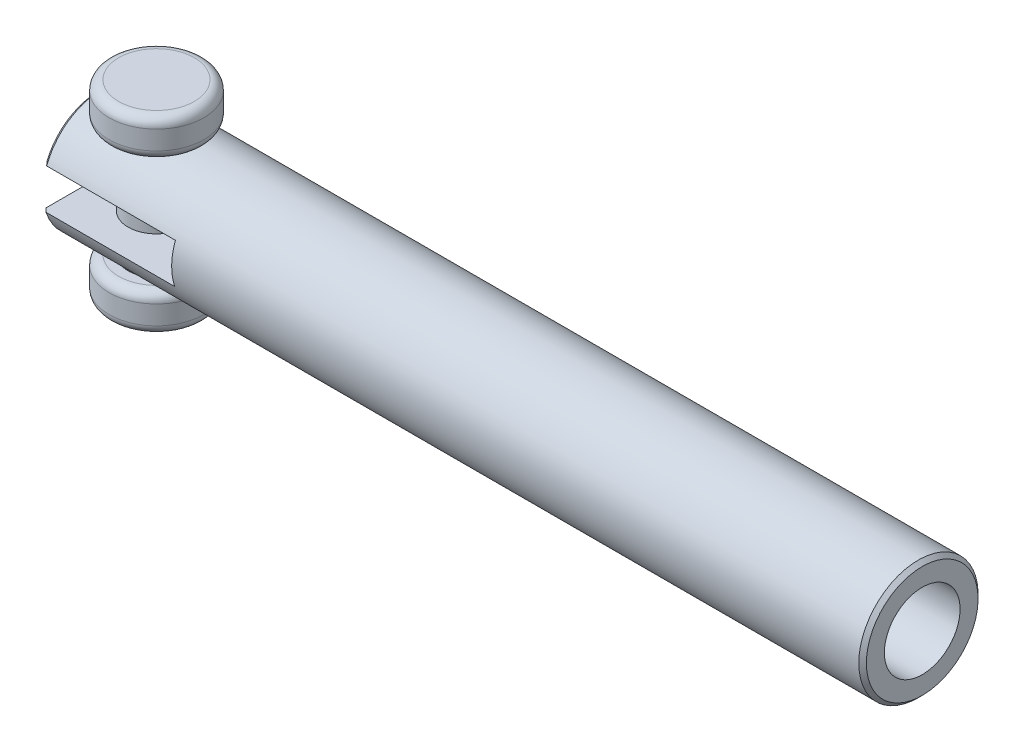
ISO-10303-21;
HEADER;
FILE_DESCRIPTION(('STEP AP214'),'2;1');
FILE_NAME('part.step','',(''),(''),'','','');
FILE_SCHEMA(('AUTOMOTIVE_DESIGN { 1 0 10303 214 1 1 1 1 }'));
ENDSEC;
DATA;
#1=APPLICATION_CONTEXT('core data for automotive mechanical design processes');
#2=APPLICATION_PROTOCOL_DEFINITION('international standard','automotive_design',2000,#1);
#3=PRODUCT_CONTEXT('',#1,'mechanical');
#4=PRODUCT('Part','Part','',(#3));
#5=PRODUCT_RELATED_PRODUCT_CATEGORY('part','',(#4));
#6=PRODUCT_DEFINITION_FORMATION('','',#4);
#7=PRODUCT_DEFINITION_CONTEXT('part definition',#1,'design');
#8=PRODUCT_DEFINITION('design','',#6,#7);
#9=PRODUCT_DEFINITION_SHAPE('','',#8);
#10=(LENGTH_UNIT() NAMED_UNIT(*) SI_UNIT(.MILLI.,.METRE.));
#11=(NAMED_UNIT(*) PLANE_ANGLE_UNIT() SI_UNIT($,.RADIAN.));
#12=(NAMED_UNIT(*) SI_UNIT($,.STERADIAN.) SOLID_ANGLE_UNIT());
#13=UNCERTAINTY_MEASURE_WITH_UNIT(LENGTH_MEASURE(1.E-05),#10,'distance_accuracy_value','');
#14=(GEOMETRIC_REPRESENTATION_CONTEXT(3) GLOBAL_UNCERTAINTY_ASSIGNED_CONTEXT((#13)) GLOBAL_UNIT_ASSIGNED_CONTEXT((#10,
#11,#12)) REPRESENTATION_CONTEXT('',''));
#15=CARTESIAN_POINT('',(0.,0.,0.));
#16=DIRECTION('',(0.,0.,1.));
#17=DIRECTION('',(1.,0.,0.));
#18=AXIS2_PLACEMENT_3D('',#15,#16,#17);
#19=CARTESIAN_POINT('',(40.45,0.,0.));
#20=DIRECTION('',(-1.,0.,0.));
#21=DIRECTION('',(0.,0.,1.));
#22=AXIS2_PLACEMENT_3D('',#19,#20,#21);
#23=PLANE('',#22);
#24=CARTESIAN_POINT('',(40.45,-0.0499999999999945,0.));
#25=DIRECTION('',(-1.,0.,0.));
#26=DIRECTION('',(0.,0.,1.));
#27=AXIS2_PLACEMENT_3D('',#24,#25,#26);
#28=CIRCLE('',#27,2.9499999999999);
#29=CARTESIAN_POINT('',(40.45,-0.0499999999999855,2.94999999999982));
#30=VERTEX_POINT('',#29);
#31=EDGE_CURVE('E25',#30,#30,#28,.T.);
#32=ORIENTED_EDGE('',*,*,#31,.F.);
#33=EDGE_LOOP('',(#32));
#34=FACE_BOUND('',#33,.T.);
#35=CARTESIAN_POINT('',(40.45,-0.0499999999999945,0.));
#36=DIRECTION('',(-1.,0.,0.));
#37=DIRECTION('',(0.,0.,1.));
#38=AXIS2_PLACEMENT_3D('',#35,#36,#37);
#39=CIRCLE('',#38,2.);
#40=CARTESIAN_POINT('',(40.45,-0.0499999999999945,1.99999999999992));
#41=VERTEX_POINT('',#40);
#42=EDGE_CURVE('E11',#41,#41,#39,.F.);
#43=ORIENTED_EDGE('',*,*,#42,.F.);
#44=EDGE_LOOP('',(#43));
#45=FACE_BOUND('',#44,.T.);
#46=ADVANCED_FACE('F17',(#34,#45),#23,.F.);
#47=CARTESIAN_POINT('',(0.,-5.05,0.));
#48=DIRECTION('',(0.,1.,0.));
#49=DIRECTION('',(-0.369618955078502,0.,0.929183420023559));
#50=AXIS2_PLACEMENT_3D('',#47,#48,#49);
#51=PLANE('',#50);
#52=CARTESIAN_POINT('',(0.,-5.05,0.));
#53=DIRECTION('',(0.,-1.,0.));
#54=DIRECTION('',(-0.369618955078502,0.,0.929183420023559));
#55=AXIS2_PLACEMENT_3D('',#52,#53,#54);
#56=CIRCLE('',#55,2.);
#57=CARTESIAN_POINT('',(-0.739237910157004,-5.05,1.85836684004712));
#58=VERTEX_POINT('',#57);
#59=EDGE_CURVE('E341',#58,#58,#56,.T.);
#60=ORIENTED_EDGE('',*,*,#59,.T.);
#61=EDGE_LOOP('',(#60));
#62=FACE_BOUND('',#61,.T.);
#63=ADVANCED_FACE('F609',(#62),#51,.F.);
#64=CARTESIAN_POINT('',(0.,4.95,0.));
#65=DIRECTION('',(0.,1.,0.));
#66=DIRECTION('',(-0.369618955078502,0.,0.929183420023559));
#67=AXIS2_PLACEMENT_3D('',#64,#65,#66);
#68=PLANE('',#67);
#69=CARTESIAN_POINT('',(0.,4.95,0.));
#70=DIRECTION('',(0.,1.,0.));
#71=DIRECTION('',(-0.369618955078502,0.,0.929183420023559));
#72=AXIS2_PLACEMENT_3D('',#69,#70,#71);
#73=CIRCLE('',#72,2.);
#74=CARTESIAN_POINT('',(-0.739237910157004,4.95,1.85836684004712));
#75=VERTEX_POINT('',#74);
#76=EDGE_CURVE('E350',#75,#75,#73,.T.);
#77=ORIENTED_EDGE('',*,*,#76,.T.);
#78=EDGE_LOOP('',(#77));
#79=FACE_BOUND('',#78,.T.);
#80=ADVANCED_FACE('F407',(#79),#68,.T.);
#81=CARTESIAN_POINT('',(0.,-4.55,0.));
#82=DIRECTION('',(0.,1.,0.));
#83=DIRECTION('',(-0.369618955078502,0.,0.929183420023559));
#84=AXIS2_PLACEMENT_3D('',#81,#82,#83);
#85=TOROIDAL_SURFACE('',#84,2.,0.5);
#86=CARTESIAN_POINT('',(0.,-4.55,0.));
#87=DIRECTION('',(0.,1.,0.));
#88=DIRECTION('',(-0.369618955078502,0.,0.929183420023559));
#89=AXIS2_PLACEMENT_3D('',#86,#87,#88);
#90=CIRCLE('',#89,2.5);
#91=CARTESIAN_POINT('',(-0.924047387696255,-4.55,2.3229585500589));
#92=VERTEX_POINT('',#91);
#93=EDGE_CURVE('E346',#92,#92,#90,.T.);
#94=ORIENTED_EDGE('',*,*,#93,.F.);
#95=EDGE_LOOP('',(#94));
#96=FACE_BOUND('',#95,.T.);
#97=ORIENTED_EDGE('',*,*,#59,.F.);
#98=EDGE_LOOP('',(#97));
#99=FACE_BOUND('',#98,.T.);
#100=ADVANCED_FACE('F403',(#96,#99),#85,.T.);
#101=CARTESIAN_POINT('',(0.,4.45,0.));
#102=DIRECTION('',(0.,1.,0.));
#103=DIRECTION('',(-0.369618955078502,0.,0.929183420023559));
#104=AXIS2_PLACEMENT_3D('',#101,#102,#103);
#105=TOROIDAL_SURFACE('',#104,2.,0.5);
#106=ORIENTED_EDGE('',*,*,#76,.F.);
#107=EDGE_LOOP('',(#106));
#108=FACE_BOUND('',#107,.T.);
#109=CARTESIAN_POINT('',(0.,4.45,0.));
#110=DIRECTION('',(0.,-1.,0.));
#111=DIRECTION('',(-0.369618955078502,0.,0.929183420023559));
#112=AXIS2_PLACEMENT_3D('',#109,#110,#111);
#113=CIRCLE('',#112,2.5);
#114=CARTESIAN_POINT('',(-0.924047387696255,4.45,2.3229585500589));
#115=VERTEX_POINT('',#114);
#116=EDGE_CURVE('E326',#115,#115,#113,.T.);
#117=ORIENTED_EDGE('',*,*,#116,.F.);
#118=EDGE_LOOP('',(#117));
#119=FACE_BOUND('',#118,.T.);
#120=ADVANCED_FACE('F406',(#108,#119),#105,.T.);
#121=CARTESIAN_POINT('',(0.,-3.05,0.));
#122=DIRECTION('',(0.,-1.,0.));
#123=DIRECTION('',(0.369618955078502,0.,-0.929183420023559));
#124=AXIS2_PLACEMENT_3D('',#121,#122,#123);
#125=CYLINDRICAL_SURFACE('',#124,2.5);
#126=ORIENTED_EDGE('',*,*,#93,.T.);
#127=EDGE_LOOP('',(#126));
#128=FACE_BOUND('',#127,.T.);
#129=CARTESIAN_POINT('',(0.,-3.55,0.));
#130=DIRECTION('',(0.,-1.,0.));
#131=DIRECTION('',(-0.369618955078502,0.,0.929183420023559));
#132=AXIS2_PLACEMENT_3D('',#129,#130,#131);
#133=CIRCLE('',#132,2.5);
#134=CARTESIAN_POINT('',(-0.924047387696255,-3.55,2.3229585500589));
#135=VERTEX_POINT('',#134);
#136=EDGE_CURVE('E329',#135,#135,#133,.T.);
#137=ORIENTED_EDGE('',*,*,#136,.T.);
#138=EDGE_LOOP('',(#137));
#139=FACE_BOUND('',#138,.T.);
#140=ADVANCED_FACE('F400',(#128,#139),#125,.T.);
#141=CARTESIAN_POINT('',(0.,4.95,0.));
#142=DIRECTION('',(0.,-1.,0.));
#143=DIRECTION('',(0.369618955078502,0.,-0.929183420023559));
#144=AXIS2_PLACEMENT_3D('',#141,#142,#143);
#145=CYLINDRICAL_SURFACE('',#144,2.5);
#146=CARTESIAN_POINT('',(0.,3.45,0.));
#147=DIRECTION('',(0.,1.,0.));
#148=DIRECTION('',(-0.369618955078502,0.,0.929183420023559));
#149=AXIS2_PLACEMENT_3D('',#146,#147,#148);
#150=CIRCLE('',#149,2.5);
#151=CARTESIAN_POINT('',(-0.924047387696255,3.45,2.3229585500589));
#152=VERTEX_POINT('',#151);
#153=EDGE_CURVE('E319',#152,#152,#150,.T.);
#154=ORIENTED_EDGE('',*,*,#153,.T.);
#155=EDGE_LOOP('',(#154));
#156=FACE_BOUND('',#155,.T.);
#157=ORIENTED_EDGE('',*,*,#116,.T.);
#158=EDGE_LOOP('',(#157));
#159=FACE_BOUND('',#158,.T.);
#160=ADVANCED_FACE('F648',(#156,#159),#145,.T.);
#161=CARTESIAN_POINT('',(-3.04999999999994,-0.0499999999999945,2.08058396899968E-13));
#162=DIRECTION('',(1.,0.,0.));
#163=DIRECTION('',(0.,0.,-1.));
#164=AXIS2_PLACEMENT_3D('',#161,#162,#163);
#165=PLANE('',#164);
#166=DIRECTION('',(0.,0.,-1.));
#167=VECTOR('',#166,1.);
#168=CARTESIAN_POINT('',(-3.04999999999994,-1.05,2.11094162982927E-13));
#169=LINE('',#168,#167);
#170=CARTESIAN_POINT('',(-3.04999999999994,-1.05,2.7753378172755));
#171=VERTEX_POINT('',#170);
#172=CARTESIAN_POINT('',(-3.05000000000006,-1.05,-2.77533781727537));
#173=VERTEX_POINT('',#172);
#174=EDGE_CURVE('E152',#171,#173,#169,.T.);
#175=ORIENTED_EDGE('',*,*,#174,.T.);
#176=CARTESIAN_POINT('',(-3.04999999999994,-0.0499999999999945,2.08058396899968E-13));
#177=DIRECTION('',(-1.,0.,0.));
#178=DIRECTION('',(0.,-1.,0.));
#179=AXIS2_PLACEMENT_3D('',#176,#177,#178);
#180=CIRCLE('',#179,2.94999999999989);
#181=EDGE_CURVE('E146',#173,#171,#180,.T.);
#182=ORIENTED_EDGE('',*,*,#181,.T.);
#183=EDGE_LOOP('',(#175,#182));
#184=FACE_BOUND('',#183,.T.);
#185=ADVANCED_FACE('F203',(#184),#165,.F.);
#186=CARTESIAN_POINT('',(0.,2.95,0.));
#187=DIRECTION('',(0.,-1.,0.));
#188=DIRECTION('',(0.369618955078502,0.,-0.929183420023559));
#189=AXIS2_PLACEMENT_3D('',#186,#187,#188);
#190=CYLINDRICAL_SURFACE('',#189,1.5);
#191=CARTESIAN_POINT('',(0.,-1.05,0.));
#192=DIRECTION('',(0.,-1.,0.));
#193=DIRECTION('',(0.,0.,1.));
#194=AXIS2_PLACEMENT_3D('',#191,#192,#193);
#195=CIRCLE('',#194,1.5);
#196=CARTESIAN_POINT('',(0.,-1.05,1.5));
#197=VERTEX_POINT('',#196);
#198=EDGE_CURVE('E448',#197,#197,#195,.F.);
#199=ORIENTED_EDGE('',*,*,#198,.T.);
#200=EDGE_LOOP('',(#199));
#201=FACE_BOUND('',#200,.T.);
#202=CARTESIAN_POINT('',(0.,1.05,0.));
#203=DIRECTION('',(0.,1.,0.));
#204=DIRECTION('',(0.,0.,-1.));
#205=AXIS2_PLACEMENT_3D('',#202,#203,#204);
#206=CIRCLE('',#205,1.5);
#207=CARTESIAN_POINT('',(0.,1.05,-1.5));
#208=VERTEX_POINT('',#207);
#209=EDGE_CURVE('E307',#208,#208,#206,.F.);
#210=ORIENTED_EDGE('',*,*,#209,.T.);
#211=EDGE_LOOP('',(#210));
#212=FACE_BOUND('',#211,.T.);
#213=ADVANCED_FACE('F674',(#201,#212),#190,.T.);
#214=CARTESIAN_POINT('',(-3.04999999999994,-0.0499999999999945,2.08058396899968E-13));
#215=DIRECTION('',(1.,0.,0.));
#216=DIRECTION('',(0.,0.,-1.));
#217=AXIS2_PLACEMENT_3D('',#214,#215,#216);
#218=PLANE('',#217);
#219=DIRECTION('',(0.,0.,1.));
#220=VECTOR('',#219,1.);
#221=CARTESIAN_POINT('',(-3.05000000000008,1.05,2.04697370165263E-13));
#222=LINE('',#221,#220);
#223=CARTESIAN_POINT('',(-3.05000000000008,1.05,-2.73724313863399));
#224=VERTEX_POINT('',#223);
#225=CARTESIAN_POINT('',(-3.05000000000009,1.05000000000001,2.73724313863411));
#226=VERTEX_POINT('',#225);
#227=EDGE_CURVE('E134',#224,#226,#222,.T.);
#228=ORIENTED_EDGE('',*,*,#227,.T.);
#229=CARTESIAN_POINT('',(-3.04999999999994,-0.0499999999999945,2.08058396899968E-13));
#230=DIRECTION('',(-1.,0.,0.));
#231=DIRECTION('',(0.,-1.,0.));
#232=AXIS2_PLACEMENT_3D('',#229,#230,#231);
#233=CIRCLE('',#232,2.94999999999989);
#234=EDGE_CURVE('E170',#226,#224,#233,.T.);
#235=ORIENTED_EDGE('',*,*,#234,.T.);
#236=EDGE_LOOP('',(#228,#235));
#237=FACE_BOUND('',#236,.T.);
#238=ADVANCED_FACE('F547',(#237),#218,.F.);
#239=CARTESIAN_POINT('',(0.554431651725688,-2.87486686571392,-1.39378161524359));
#240=CARTESIAN_POINT('',(0.5321700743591,-2.87049017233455,-1.40265145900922));
#241=CARTESIAN_POINT('',(0.509663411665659,-2.86631391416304,-1.4110110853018));
#242=CARTESIAN_POINT('',(0.464473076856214,-2.85846212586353,-1.42657494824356));
#243=CARTESIAN_POINT('',(0.441794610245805,-2.85478127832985,-1.43379163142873));
#244=CARTESIAN_POINT('',(0.396260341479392,-2.84794663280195,-1.44708322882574));
#245=CARTESIAN_POINT('',(0.373408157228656,-2.84478824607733,-1.45316814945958));
#246=CARTESIAN_POINT('',(0.327528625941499,-2.83901909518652,-1.46421005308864));
#247=CARTESIAN_POINT('',(0.304503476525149,-2.8364048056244,-1.46917431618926));
#248=CARTESIAN_POINT('',(0.258279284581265,-2.8317404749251,-1.47798671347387));
#249=CARTESIAN_POINT('',(0.235081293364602,-2.829688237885,-1.48183919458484));
#250=CARTESIAN_POINT('',(0.188512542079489,-2.82616011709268,-1.4884384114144));
#251=CARTESIAN_POINT('',(0.165142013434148,-2.82468356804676,-1.4911864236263));
#252=CARTESIAN_POINT('',(0.118229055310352,-2.82231559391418,-1.4955844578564));
#253=CARTESIAN_POINT('',(0.0946864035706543,-2.82142515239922,-1.49723263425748));
#254=CARTESIAN_POINT('',(0.0474291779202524,-2.82023134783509,-1.49943939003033));
#255=CARTESIAN_POINT('',(0.0237143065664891,-2.81993063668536,-1.4999930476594));
#256=CARTESIAN_POINT('',(0.,-2.81992779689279,-1.50000000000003));
#257=B_SPLINE_CURVE_WITH_KNOTS('',3,(#239,#240,#241,#242,#243,#244,#245,#246,#247,#248,#249,
#250,#251,#252,#253,#254,#255,#256),.UNSPECIFIED.,.F.,.F.,(4,2,2,2,2,2,2,2,4),(0.,
0.073075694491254,0.145290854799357,0.216833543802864,0.287897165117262,0.358679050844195,
0.42937889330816,0.50019707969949,0.571332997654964),.UNSPECIFIED.);
#258=CARTESIAN_POINT('',(0.554428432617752,-2.87487006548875,-1.39377513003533));
#259=VERTEX_POINT('',#258);
#260=CARTESIAN_POINT('',(0.,-2.8199277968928,-1.5));
#261=VERTEX_POINT('',#260);
#262=EDGE_CURVE('E906',#259,#261,#257,.T.);
#263=ORIENTED_EDGE('',*,*,#262,.F.);
#264=CARTESIAN_POINT('',(1.15262057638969,-3.05009550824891,-0.960170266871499));
#265=CARTESIAN_POINT('',(1.13929249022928,-3.04499064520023,-0.976120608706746));
#266=CARTESIAN_POINT('',(1.12563752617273,-3.03983778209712,-0.991782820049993));
#267=CARTESIAN_POINT('',(1.09479354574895,-3.02838130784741,-1.02573356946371));
#268=CARTESIAN_POINT('',(1.07746196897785,-3.02206208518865,-1.04388760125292));
#269=CARTESIAN_POINT('',(1.04772779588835,-3.01143644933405,-1.07357139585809));
#270=CARTESIAN_POINT('',(1.03555396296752,-3.00714335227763,-1.08533649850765));
#271=CARTESIAN_POINT('',(1.00788214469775,-2.99753266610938,-1.11120845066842));
#272=CARTESIAN_POINT('',(0.99228232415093,-2.99221431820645,-1.12520655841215));
#273=CARTESIAN_POINT('',(0.96064483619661,-2.98166039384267,-1.15242288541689));
#274=CARTESIAN_POINT('',(0.94461226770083,-2.97642450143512,-1.16564691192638));
#275=CARTESIAN_POINT('',(0.912110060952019,-2.96606494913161,-1.19132509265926));
#276=CARTESIAN_POINT('',(0.895644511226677,-2.96094074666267,-1.20378419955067));
#277=CARTESIAN_POINT('',(0.862277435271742,-2.95083235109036,-1.22794223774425));
#278=CARTESIAN_POINT('',(0.845378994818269,-2.94584751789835,-1.23964516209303));
#279=CARTESIAN_POINT('',(0.81114715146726,-2.93604371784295,-1.26230082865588));
#280=CARTESIAN_POINT('',(0.793815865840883,-2.9312241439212,-1.27325650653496));
#281=CARTESIAN_POINT('',(0.758719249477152,-2.92177491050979,-1.29442764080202));
#282=CARTESIAN_POINT('',(0.740955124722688,-2.91714480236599,-1.30464489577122));
#283=CARTESIAN_POINT('',(0.704993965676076,-2.90809669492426,-1.32434916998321));
#284=CARTESIAN_POINT('',(0.686797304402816,-2.90367852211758,-1.33383679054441));
#285=CARTESIAN_POINT('',(0.649971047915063,-2.89507489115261,-1.3520912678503));
#286=CARTESIAN_POINT('',(0.631341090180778,-2.89088963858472,-1.36085749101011));
#287=CARTESIAN_POINT('',(0.601378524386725,-2.88443461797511,-1.37423100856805));
#288=CARTESIAN_POINT('',(0.590169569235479,-2.8820799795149,-1.37907597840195));
#289=CARTESIAN_POINT('',(0.570774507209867,-2.87811267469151,-1.38718888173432));
#290=CARTESIAN_POINT('',(0.562619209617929,-2.876476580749,-1.39051908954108));
#291=CARTESIAN_POINT('',(0.554431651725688,-2.87486686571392,-1.39378161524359));
#292=B_SPLINE_CURVE_WITH_KNOTS('',3,(#264,#265,#266,#267,#268,#269,#270,#271,#272,#273,#274,
#275,#276,#277,#278,#279,#280,#281,#282,#283,#284,#285,#286,#287,#288,#289,#290,#291),
.UNSPECIFIED.,.F.,.F.,(4,2,2,2,2,2,2,2,2,2,2,2,2,4),(0.,0.064207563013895,0.141822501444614,
0.194212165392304,0.259065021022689,0.323343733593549,0.387149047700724,0.450583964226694,
0.51375329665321,0.576763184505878,0.639720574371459,0.702732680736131,0.740037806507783,
0.766915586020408),.UNSPECIFIED.);
#293=CARTESIAN_POINT('',(1.15251727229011,-3.05,-0.960054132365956));
#294=VERTEX_POINT('',#293);
#295=EDGE_CURVE('E393',#294,#259,#292,.T.);
#296=ORIENTED_EDGE('',*,*,#295,.F.);
#297=CARTESIAN_POINT('',(0.,-3.05,0.));
#298=DIRECTION('',(0.,1.,0.));
#299=DIRECTION('',(-0.369618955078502,0.,0.929183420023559));
#300=AXIS2_PLACEMENT_3D('',#297,#298,#299);
#301=CIRCLE('',#300,1.5);
#302=CARTESIAN_POINT('',(-1.1522932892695,-3.05,-0.96032295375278));
#303=VERTEX_POINT('',#302);
#304=EDGE_CURVE('E320',#294,#303,#301,.T.);
#305=ORIENTED_EDGE('',*,*,#304,.T.);
#306=CARTESIAN_POINT('',(0.,-2.81992779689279,-1.50000000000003));
#307=CARTESIAN_POINT('',(-0.0138857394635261,-2.81993027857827,-1.49999521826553));
#308=CARTESIAN_POINT('',(-0.0277715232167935,-2.8200340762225,-1.49980373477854));
#309=CARTESIAN_POINT('',(-0.0554844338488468,-2.82044462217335,-1.49904534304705));
#310=CARTESIAN_POINT('',(-0.0693116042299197,-2.82075070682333,-1.49847966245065));
#311=CARTESIAN_POINT('',(-0.0969073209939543,-2.82156520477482,-1.49697261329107));
#312=CARTESIAN_POINT('',(-0.110675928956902,-2.82207314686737,-1.49603211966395));
#313=CARTESIAN_POINT('',(-0.138154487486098,-2.82328995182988,-1.49377524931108));
#314=CARTESIAN_POINT('',(-0.151864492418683,-2.82399853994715,-1.49245938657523));
#315=CARTESIAN_POINT('',(-0.179225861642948,-2.82561485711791,-1.48945126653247));
#316=CARTESIAN_POINT('',(-0.192877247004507,-2.82652250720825,-1.48775915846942));
#317=CARTESIAN_POINT('',(-0.220121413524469,-2.82853468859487,-1.483997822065));
#318=CARTESIAN_POINT('',(-0.233714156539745,-2.82963933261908,-1.4819283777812));
#319=CARTESIAN_POINT('',(-0.260841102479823,-2.83204279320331,-1.47741140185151));
#320=CARTESIAN_POINT('',(-0.274375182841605,-2.83334190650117,-1.47496329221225));
#321=CARTESIAN_POINT('',(-0.301384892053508,-2.83613114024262,-1.46968778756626));
#322=CARTESIAN_POINT('',(-0.31486029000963,-2.83762173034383,-1.46685945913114));
#323=CARTESIAN_POINT('',(-0.341752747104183,-2.84079030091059,-1.4608220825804));
#324=CARTESIAN_POINT('',(-0.35516944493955,-2.84246890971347,-1.45761175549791));
#325=CARTESIAN_POINT('',(-0.381944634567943,-2.84600943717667,-1.45080873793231));
#326=CARTESIAN_POINT('',(-0.395302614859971,-2.84787212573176,-1.44721443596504));
#327=CARTESIAN_POINT('',(-0.421960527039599,-2.85177630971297,-1.43964153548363));
#328=CARTESIAN_POINT('',(-0.435259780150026,-2.85381869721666,-1.43566100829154));
#329=CARTESIAN_POINT('',(-0.461800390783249,-2.858077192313,-1.4273137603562));
#330=CARTESIAN_POINT('',(-0.475040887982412,-2.86029429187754,-1.42294481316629));
#331=CARTESIAN_POINT('',(-0.503600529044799,-2.86526927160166,-1.41307975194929));
#332=CARTESIAN_POINT('',(-0.518892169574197,-2.86805516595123,-1.40751802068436));
#333=CARTESIAN_POINT('',(-0.549399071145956,-2.87384299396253,-1.39587013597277));
#334=CARTESIAN_POINT('',(-0.564612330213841,-2.87684668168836,-1.38977962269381));
#335=CARTESIAN_POINT('',(-0.600693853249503,-2.88424070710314,-1.37465470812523));
#336=CARTESIAN_POINT('',(-0.621452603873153,-2.88871481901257,-1.36539885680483));
#337=CARTESIAN_POINT('',(-0.666528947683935,-2.89889302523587,-1.34405155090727));
#338=CARTESIAN_POINT('',(-0.690737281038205,-2.90466524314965,-1.33176152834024));
#339=CARTESIAN_POINT('',(-0.738597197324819,-2.9166325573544,-1.30580392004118));
#340=CARTESIAN_POINT('',(-0.762241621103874,-2.92283105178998,-1.29212471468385));
#341=CARTESIAN_POINT('',(-0.802849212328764,-2.93392045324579,-1.267138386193));
#342=CARTESIAN_POINT('',(-0.819996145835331,-2.93874780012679,-1.25610079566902));
#343=CARTESIAN_POINT('',(-0.8427218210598,-2.94532018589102,-1.24082197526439));
#344=CARTESIAN_POINT('',(-0.848512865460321,-2.94701058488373,-1.23687043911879));
#345=CARTESIAN_POINT('',(-0.876477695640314,-2.95524775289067,-1.21750345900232));
#346=CARTESIAN_POINT('',(-0.89825333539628,-2.96189019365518,-1.2015462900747));
#347=CARTESIAN_POINT('',(-0.940902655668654,-2.97531376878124,-1.16848533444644));
#348=CARTESIAN_POINT('',(-0.961775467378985,-2.98209502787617,-1.15138048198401));
#349=CARTESIAN_POINT('',(-1.00262541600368,-2.99574070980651,-1.11600723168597));
#350=CARTESIAN_POINT('',(-1.02259907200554,-3.00260534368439,-1.09773488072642));
#351=CARTESIAN_POINT('',(-1.04833241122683,-3.01166620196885,-1.07288158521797));
#352=CARTESIAN_POINT('',(-1.05454900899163,-3.01387255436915,-1.06677193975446));
#353=CARTESIAN_POINT('',(-1.07365422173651,-3.02070483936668,-1.04766484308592));
#354=CARTESIAN_POINT('',(-1.08636138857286,-3.02532311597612,-1.03448215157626));
#355=CARTESIAN_POINT('',(-1.11717018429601,-3.03668677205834,-1.00131819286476));
#356=CARTESIAN_POINT('',(-1.13498801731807,-3.04340759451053,-0.981064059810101));
#357=CARTESIAN_POINT('',(-1.15225116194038,-3.05004724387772,-0.960321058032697));
#358=B_SPLINE_CURVE_WITH_KNOTS('',3,(#306,#307,#308,#309,#310,#311,#312,#313,#314,#315,#316,
#317,#318,#319,#320,#321,#322,#323,#324,#325,#326,#327,#328,#329,#330,#331,#332,#333,#334,#335,
#336,#337,#338,#339,#340,#341,#342,#343,#344,#345,#346,#347,#348,#349,#350,#351,#352,#353,#354,
#355,#356,#357),.UNSPECIFIED.,.F.,.F.,(4,2,2,2,2,2,2,2,2,2,2,2,2,2,2,2,2,2,2,2,2,2,2,2,2,4),(0.,
0.0416557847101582,0.0831755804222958,0.124599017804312,0.165966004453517,0.207316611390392,
0.248690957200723,0.290129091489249,0.331670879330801,0.373355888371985,0.415223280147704,
0.457311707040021,0.49965921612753,0.549174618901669,0.599146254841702,0.668615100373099,
0.751840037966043,0.835829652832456,0.898679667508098,0.920314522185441,1.00367526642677,
1.0871145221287,1.17085303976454,1.1978260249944,1.25446383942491,1.33782636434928),.UNSPECIFIED.);
#359=EDGE_CURVE('E439',#261,#303,#358,.T.);
#360=ORIENTED_EDGE('',*,*,#359,.F.);
#361=EDGE_LOOP('',(#263,#296,#305,#360));
#362=FACE_BOUND('',#361,.T.);
#363=ADVANCED_FACE('F683',(#362),#190,.T.);
#364=CARTESIAN_POINT('',(0.,-3.05,0.));
#365=DIRECTION('',(0.,1.,0.));
#366=DIRECTION('',(-0.369618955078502,0.,0.929183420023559));
#367=AXIS2_PLACEMENT_3D('',#364,#365,#366);
#368=PLANE('',#367);
#369=DIRECTION('',(-1.,0.,0.));
#370=VECTOR('',#369,1.);
#371=CARTESIAN_POINT('',(40.45,-3.05,-0.960468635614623));
#372=LINE('',#371,#370);
#373=CARTESIAN_POINT('',(1.75428047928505,-3.05,-0.960468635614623));
#374=VERTEX_POINT('',#373);
#375=EDGE_CURVE('E427',#374,#294,#372,.T.);
#376=ORIENTED_EDGE('',*,*,#375,.F.);
#377=CARTESIAN_POINT('',(0.,-3.05,0.));
#378=DIRECTION('',(0.,1.,0.));
#379=DIRECTION('',(-0.369618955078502,0.,0.929183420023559));
#380=AXIS2_PLACEMENT_3D('',#377,#378,#379);
#381=CIRCLE('',#380,2.);
#382=CARTESIAN_POINT('',(-1.75428047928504,-3.05,-0.960468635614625));
#383=VERTEX_POINT('',#382);
#384=EDGE_CURVE('E347',#374,#383,#381,.T.);
#385=ORIENTED_EDGE('',*,*,#384,.T.);
#386=EDGE_CURVE('E425',#303,#383,#372,.T.);
#387=ORIENTED_EDGE('',*,*,#386,.F.);
#388=ORIENTED_EDGE('',*,*,#304,.F.);
#389=EDGE_LOOP('',(#376,#385,#387,#388));
#390=FACE_BOUND('',#389,.T.);
#391=ADVANCED_FACE('F421',(#390),#368,.T.);
#392=CARTESIAN_POINT('',(-0.554431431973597,-2.87486708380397,1.39378117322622));
#393=CARTESIAN_POINT('',(-0.532168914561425,-2.87049041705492,1.40265096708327));
#394=CARTESIAN_POINT('',(-0.509661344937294,-2.866314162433,1.41101059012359));
#395=CARTESIAN_POINT('',(-0.464469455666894,-2.85846238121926,1.42657444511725));
#396=CARTESIAN_POINT('',(-0.441790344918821,-2.85478153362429,1.43379113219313));
#397=CARTESIAN_POINT('',(-0.396255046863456,-2.84794688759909,1.44708273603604));
#398=CARTESIAN_POINT('',(-0.373402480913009,-2.84478849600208,1.45316766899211));
#399=CARTESIAN_POINT('',(-0.327522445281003,-2.83901933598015,1.46420959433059));
#400=CARTESIAN_POINT('',(-0.304497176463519,-2.83640503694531,1.4691738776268));
#401=CARTESIAN_POINT('',(-0.258273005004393,-2.83174068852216,1.4779863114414));
#402=CARTESIAN_POINT('',(-0.235075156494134,-2.82968843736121,1.48183882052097));
#403=CARTESIAN_POINT('',(-0.188506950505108,-2.82616029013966,1.4884380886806));
#404=CARTESIAN_POINT('',(-0.165136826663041,-2.82468372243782,1.49118613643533));
#405=CARTESIAN_POINT('',(-0.118224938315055,-2.82231571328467,1.4955842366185));
#406=CARTESIAN_POINT('',(-0.0946829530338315,-2.82142524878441,1.4972324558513));
#407=CARTESIAN_POINT('',(-0.0474273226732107,-2.82023140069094,1.49943929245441));
#408=CARTESIAN_POINT('',(-0.0237133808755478,-2.81993066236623,1.49999300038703));
#409=CARTESIAN_POINT('',(0.,-2.8199277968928,1.49999999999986));
#410=B_SPLINE_CURVE_WITH_KNOTS('',3,(#392,#393,#394,#395,#396,#397,#398,#399,#400,#401,#402,
#403,#404,#405,#406,#407,#408,#409),.UNSPECIFIED.,.F.,.F.,(4,2,2,2,2,2,2,2,4),(0.,
0.0730782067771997,0.145295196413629,0.216838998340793,0.287902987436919,0.358684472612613,
0.429383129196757,0.500199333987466,0.571332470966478),.UNSPECIFIED.);
#411=CARTESIAN_POINT('',(-0.554428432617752,-2.87487006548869,1.39377513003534));
#412=VERTEX_POINT('',#411);
#413=CARTESIAN_POINT('',(0.,-2.81992779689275,1.5));
#414=VERTEX_POINT('',#413);
#415=EDGE_CURVE('E302',#412,#414,#410,.T.);
#416=ORIENTED_EDGE('',*,*,#415,.F.);
#417=CARTESIAN_POINT('',(-1.15262792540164,-3.05009732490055,0.960164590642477));
#418=CARTESIAN_POINT('',(-1.13929737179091,-3.04499144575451,0.976118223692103));
#419=CARTESIAN_POINT('',(-1.12563958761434,-3.03983753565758,0.991783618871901));
#420=CARTESIAN_POINT('',(-1.0944999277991,-3.02827152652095,1.0260588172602));
#421=CARTESIAN_POINT('',(-1.07685975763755,-3.02184211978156,1.04451930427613));
#422=CARTESIAN_POINT('',(-1.04709747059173,-3.01121453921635,1.07417945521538));
#423=CARTESIAN_POINT('',(-1.03522818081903,-3.00703075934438,1.08563970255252));
#424=CARTESIAN_POINT('',(-1.00786665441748,-2.99752835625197,1.1112199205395));
#425=CARTESIAN_POINT('',(-0.992262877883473,-2.99220888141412,1.12522081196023));
#426=CARTESIAN_POINT('',(-0.960618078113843,-2.98165287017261,1.15244205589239));
#427=CARTESIAN_POINT('',(-0.944582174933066,-2.97641601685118,1.16566824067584));
#428=CARTESIAN_POINT('',(-0.912073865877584,-2.96605472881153,1.19135012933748));
#429=CARTESIAN_POINT('',(-0.895605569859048,-2.96092974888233,1.2038108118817));
#430=CARTESIAN_POINT('',(-0.862233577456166,-2.95082001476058,1.2279713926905));
#431=CARTESIAN_POINT('',(-0.845332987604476,-2.9458346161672,1.23967531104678));
#432=CARTESIAN_POINT('',(-0.811097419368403,-2.93602992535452,1.26233236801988));
#433=CARTESIAN_POINT('',(-0.793764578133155,-2.93121002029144,1.27328846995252));
#434=CARTESIAN_POINT('',(-0.758665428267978,-2.92176038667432,1.29445986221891));
#435=CARTESIAN_POINT('',(-0.74090034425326,-2.91713020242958,1.30467697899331));
#436=CARTESIAN_POINT('',(-0.7049378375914,-2.90808222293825,1.32438039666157));
#437=CARTESIAN_POINT('',(-0.686740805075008,-2.90366424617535,1.33386732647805));
#438=CARTESIAN_POINT('',(-0.649914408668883,-2.89506130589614,1.35211984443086));
#439=CARTESIAN_POINT('',(-0.631284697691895,-2.8908765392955,1.36088482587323));
#440=CARTESIAN_POINT('',(-0.601053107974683,-2.88436441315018,1.37437633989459));
#441=CARTESIAN_POINT('',(-0.589571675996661,-2.88195437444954,1.37933435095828));
#442=CARTESIAN_POINT('',(-0.570189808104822,-2.87799550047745,1.38742736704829));
#443=CARTESIAN_POINT('',(-0.562325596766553,-2.87641903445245,1.39063572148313));
#444=CARTESIAN_POINT('',(-0.554431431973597,-2.87486708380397,1.39378117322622));
#445=B_SPLINE_CURVE_WITH_KNOTS('',3,(#417,#418,#419,#420,#421,#422,#423,#424,#425,#426,#427,
#428,#429,#430,#431,#432,#433,#434,#435,#436,#437,#438,#439,#440,#441,#442,#443,#444),
.UNSPECIFIED.,.F.,.F.,(4,2,2,2,2,2,2,2,2,2,2,2,2,4),(0.,0.0642205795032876,0.143179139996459,
0.194236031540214,0.25910359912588,0.323394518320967,0.387209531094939,0.450651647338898,
0.513825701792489,0.576837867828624,0.639795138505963,0.7028047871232,0.74100997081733,
0.766924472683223),.UNSPECIFIED.);
#446=CARTESIAN_POINT('',(-1.15252335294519,-3.05,0.960046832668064));
#447=VERTEX_POINT('',#446);
#448=EDGE_CURVE('E313',#447,#412,#445,.T.);
#449=ORIENTED_EDGE('',*,*,#448,.F.);
#450=CARTESIAN_POINT('',(1.15250697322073,-3.05,0.960066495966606));
#451=VERTEX_POINT('',#450);
#452=EDGE_CURVE('E310',#447,#451,#301,.T.);
#453=ORIENTED_EDGE('',*,*,#452,.T.);
#454=CARTESIAN_POINT('',(0.,-2.8199277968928,1.49999999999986));
#455=CARTESIAN_POINT('',(0.0184686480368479,-2.81993076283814,1.49999389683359));
#456=CARTESIAN_POINT('',(0.0369374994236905,-2.82011354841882,1.49965696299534));
#457=CARTESIAN_POINT('',(0.0737712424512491,-2.82083841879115,1.49831756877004));
#458=CARTESIAN_POINT('',(0.0921362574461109,-2.82137908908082,1.49731772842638));
#459=CARTESIAN_POINT('',(0.128762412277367,-2.82281778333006,1.49465169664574));
#460=CARTESIAN_POINT('',(0.147023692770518,-2.82371500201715,1.4929870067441));
#461=CARTESIAN_POINT('',(0.183442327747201,-2.82586237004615,1.4889906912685));
#462=CARTESIAN_POINT('',(0.201599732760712,-2.8271123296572,1.4866594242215));
#463=CARTESIAN_POINT('',(0.237810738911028,-2.82995959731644,1.48132837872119));
#464=CARTESIAN_POINT('',(0.255864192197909,-2.83155731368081,1.47832781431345));
#465=CARTESIAN_POINT('',(0.291867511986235,-2.83509301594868,1.47165593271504));
#466=CARTESIAN_POINT('',(0.309816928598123,-2.8370319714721,1.46798270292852));
#467=CARTESIAN_POINT('',(0.345612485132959,-2.84124167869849,1.45996249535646));
#468=CARTESIAN_POINT('',(0.363457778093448,-2.84351390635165,1.4556125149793));
#469=CARTESIAN_POINT('',(0.39904554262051,-2.8483802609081,1.4462351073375));
#470=CARTESIAN_POINT('',(0.416786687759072,-2.85097629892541,1.44120364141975));
#471=CARTESIAN_POINT('',(0.452166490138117,-2.85647898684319,1.43045880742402));
#472=CARTESIAN_POINT('',(0.469803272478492,-2.85938789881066,1.42474043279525));
#473=CARTESIAN_POINT('',(0.504975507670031,-2.86550354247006,1.41261683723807));
#474=CARTESIAN_POINT('',(0.522508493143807,-2.86871279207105,1.40620572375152));
#475=CARTESIAN_POINT('',(0.553154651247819,-2.87458766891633,1.39435905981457));
#476=CARTESIAN_POINT('',(0.566328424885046,-2.87720135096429,1.38905351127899));
#477=CARTESIAN_POINT('',(0.600175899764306,-2.88412990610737,1.37488231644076));
#478=CARTESIAN_POINT('',(0.620719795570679,-2.88854398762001,1.36575267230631));
#479=CARTESIAN_POINT('',(0.657311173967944,-2.89676510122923,1.34851794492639));
#480=CARTESIAN_POINT('',(0.673443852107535,-2.90051937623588,1.3405676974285));
#481=CARTESIAN_POINT('',(0.705378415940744,-2.90820054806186,1.32411180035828));
#482=CARTESIAN_POINT('',(0.72118035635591,-2.91212741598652,1.31560624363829));
#483=CARTESIAN_POINT('',(0.752453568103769,-2.92013905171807,1.29803511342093));
#484=CARTESIAN_POINT('',(0.767924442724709,-2.92422399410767,1.28896891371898));
#485=CARTESIAN_POINT('',(0.79853606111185,-2.9325363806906,1.27027120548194));
#486=CARTESIAN_POINT('',(0.81367590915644,-2.93676414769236,1.2606383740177));
#487=CARTESIAN_POINT('',(0.84362595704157,-2.94534578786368,1.24080214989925));
#488=CARTESIAN_POINT('',(0.858434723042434,-2.94970007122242,1.23059677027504));
#489=CARTESIAN_POINT('',(0.887723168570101,-2.95851743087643,1.20961007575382));
#490=CARTESIAN_POINT('',(0.902200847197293,-2.96298094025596,1.1988261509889));
#491=CARTESIAN_POINT('',(0.930827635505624,-2.97199846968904,1.17667701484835));
#492=CARTESIAN_POINT('',(0.944974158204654,-2.97655287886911,1.16530861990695));
#493=CARTESIAN_POINT('',(0.972939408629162,-2.98573302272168,1.14198503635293));
#494=CARTESIAN_POINT('',(0.986754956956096,-2.9903590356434,1.13002614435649));
#495=CARTESIAN_POINT('',(1.01069376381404,-2.99851567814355,1.10853686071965));
#496=CARTESIAN_POINT('',(1.02091030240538,-3.00204385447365,1.09910918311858));
#497=CARTESIAN_POINT('',(1.0411565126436,-3.00912016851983,1.07991351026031));
#498=CARTESIAN_POINT('',(1.05118437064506,-3.01266827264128,1.07014359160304));
#499=CARTESIAN_POINT('',(1.07710989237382,-3.02194237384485,1.04419767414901));
#500=CARTESIAN_POINT('',(1.09279465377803,-3.02765562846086,1.0278032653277));
#501=CARTESIAN_POINT('',(1.12331414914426,-3.03896155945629,0.994442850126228));
#502=CARTESIAN_POINT('',(1.13815440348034,-3.04455482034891,0.977482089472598));
#503=CARTESIAN_POINT('',(1.15261030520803,-3.05009190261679,0.960181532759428));
#504=B_SPLINE_CURVE_WITH_KNOTS('',3,(#454,#455,#456,#457,#458,#459,#460,#461,#462,#463,#464,
#465,#466,#467,#468,#469,#470,#471,#472,#473,#474,#475,#476,#477,#478,#479,#480,#481,#482,#483,
#484,#485,#486,#487,#488,#489,#490,#491,#492,#493,#494,#495,#496,#497,#498,#499,#500,#501,#502,
#503),.UNSPECIFIED.,.F.,.F.,(4,2,2,2,2,2,2,2,2,2,2,2,2,2,2,2,2,2,2,2,2,2,2,2,4),(0.,
0.0554026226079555,0.110587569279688,0.165648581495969,0.220680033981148,0.275776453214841,
0.331032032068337,0.386540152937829,0.442392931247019,0.498680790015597,0.555492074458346,
0.598808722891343,0.667514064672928,0.722621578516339,0.777719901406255,0.832880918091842,
0.888176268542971,0.943677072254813,0.999453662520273,1.05557533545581,1.11211011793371,
1.15513271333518,1.1984571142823,1.26862595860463,1.33826540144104),.UNSPECIFIED.);
#505=EDGE_CURVE('E285',#414,#451,#504,.T.);
#506=ORIENTED_EDGE('',*,*,#505,.F.);
#507=EDGE_LOOP('',(#416,#449,#453,#506));
#508=FACE_BOUND('',#507,.T.);
#509=ADVANCED_FACE('F311',(#508),#190,.T.);
#510=DIRECTION('',(-1.,0.,0.));
#511=VECTOR('',#510,1.);
#512=CARTESIAN_POINT('',(40.45,-3.05,0.96046863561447));
#513=LINE('',#512,#511);
#514=CARTESIAN_POINT('',(-1.75428047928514,-3.05,0.960468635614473));
#515=VERTEX_POINT('',#514);
#516=EDGE_CURVE('E440',#515,#447,#513,.F.);
#517=ORIENTED_EDGE('',*,*,#516,.F.);
#518=CARTESIAN_POINT('',(1.75428047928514,-3.05,0.960468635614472));
#519=VERTEX_POINT('',#518);
#520=EDGE_CURVE('E342',#515,#519,#381,.T.);
#521=ORIENTED_EDGE('',*,*,#520,.T.);
#522=EDGE_CURVE('E298',#451,#519,#513,.F.);
#523=ORIENTED_EDGE('',*,*,#522,.F.);
#524=ORIENTED_EDGE('',*,*,#452,.F.);
#525=EDGE_LOOP('',(#517,#521,#523,#524));
#526=FACE_BOUND('',#525,.T.);
#527=ADVANCED_FACE('F466',(#526),#368,.T.);
#528=CARTESIAN_POINT('',(0.,-3.55,0.));
#529=DIRECTION('',(0.,1.,0.));
#530=DIRECTION('',(-0.369618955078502,0.,0.929183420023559));
#531=AXIS2_PLACEMENT_3D('',#528,#529,#530);
#532=TOROIDAL_SURFACE('',#531,2.,0.5);
#533=ORIENTED_EDGE('',*,*,#520,.F.);
#534=CARTESIAN_POINT('',(-1.64292566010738,-3.19999688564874,0.00442949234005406));
#535=CARTESIAN_POINT('',(-1.64299021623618,-3.20005929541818,-0.039531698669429));
#536=CARTESIAN_POINT('',(-1.64217295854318,-3.19919993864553,-0.0834879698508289));
#537=CARTESIAN_POINT('',(-1.63889662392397,-3.19564723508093,-0.17126496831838));
#538=CARTESIAN_POINT('',(-1.6364375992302,-3.19295394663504,-0.215085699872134));
#539=CARTESIAN_POINT('',(-1.63017088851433,-3.18573074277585,-0.302716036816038));
#540=CARTESIAN_POINT('',(-1.62635586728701,-3.18119081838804,-0.346524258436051));
#541=CARTESIAN_POINT('',(-1.61799996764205,-3.17029370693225,-0.433822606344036));
#542=CARTESIAN_POINT('',(-1.61345940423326,-3.16393730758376,-0.477312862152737));
#543=CARTESIAN_POINT('',(-1.60682334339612,-3.15270314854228,-0.544342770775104));
#544=CARTESIAN_POINT('',(-1.60455383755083,-3.14846467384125,-0.567973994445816));
#545=CARTESIAN_POINT('',(-1.60051183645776,-3.13943263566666,-0.615211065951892));
#546=CARTESIAN_POINT('',(-1.59874000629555,-3.13463834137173,-0.638816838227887));
#547=CARTESIAN_POINT('',(-1.59625525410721,-3.12453736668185,-0.685779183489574));
#548=CARTESIAN_POINT('',(-1.59553401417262,-3.11923506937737,-0.70913624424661));
#549=CARTESIAN_POINT('',(-1.59603833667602,-3.10810389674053,-0.755690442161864));
#550=CARTESIAN_POINT('',(-1.59725802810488,-3.10227665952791,-0.778887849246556));
#551=CARTESIAN_POINT('',(-1.60184092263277,-3.09336714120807,-0.812739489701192));
#552=CARTESIAN_POINT('',(-1.60375259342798,-3.0904400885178,-0.823619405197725));
#553=CARTESIAN_POINT('',(-1.60878243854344,-3.08453833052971,-0.845103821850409));
#554=CARTESIAN_POINT('',(-1.61190062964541,-3.0815636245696,-0.855708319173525));
#555=CARTESIAN_POINT('',(-1.61900628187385,-3.07623608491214,-0.874339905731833));
#556=CARTESIAN_POINT('',(-1.62271009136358,-3.07387396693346,-0.882469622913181));
#557=CARTESIAN_POINT('',(-1.63141660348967,-3.06928421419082,-0.898046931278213));
#558=CARTESIAN_POINT('',(-1.63641649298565,-3.06705630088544,-0.905495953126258));
#559=CARTESIAN_POINT('',(-1.6466149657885,-3.06332599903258,-0.917822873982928));
#560=CARTESIAN_POINT('',(-1.65154005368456,-3.06177057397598,-0.922909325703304));
#561=CARTESIAN_POINT('',(-1.66222283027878,-3.05890765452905,-0.932200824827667));
#562=CARTESIAN_POINT('',(-1.6679798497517,-3.05759996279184,-0.936406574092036));
#563=CARTESIAN_POINT('',(-1.68017206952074,-3.05528982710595,-0.943794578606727));
#564=CARTESIAN_POINT('',(-1.68660740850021,-3.05428744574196,-0.946976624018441));
#565=CARTESIAN_POINT('',(-1.69993850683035,-3.05260775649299,-0.952289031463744));
#566=CARTESIAN_POINT('',(-1.70683474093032,-3.0519307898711,-0.954418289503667));
#567=CARTESIAN_POINT('',(-1.72324475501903,-3.05071227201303,-0.958243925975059));
#568=CARTESIAN_POINT('',(-1.73285701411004,-3.05029336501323,-0.959552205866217));
#569=CARTESIAN_POINT('',(-1.75217509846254,-3.04992617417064,-0.960699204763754));
#570=CARTESIAN_POINT('',(-1.76188108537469,-3.04997894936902,-0.960534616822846));
#571=CARTESIAN_POINT('',(-1.78690610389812,-3.05060331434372,-0.958583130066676));
#572=CARTESIAN_POINT('',(-1.80214384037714,-3.05146374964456,-0.95589287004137));
#573=CARTESIAN_POINT('',(-1.83202336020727,-3.05384076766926,-0.948396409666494));
#574=CARTESIAN_POINT('',(-1.84666359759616,-3.05535894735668,-0.943585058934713));
#575=CARTESIAN_POINT('',(-1.88630046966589,-3.06019737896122,-0.928072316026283));
#576=CARTESIAN_POINT('',(-1.91057622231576,-3.06400443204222,-0.915690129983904));
#577=CARTESIAN_POINT('',(-1.95696836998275,-3.07238427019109,-0.887643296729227));
#578=CARTESIAN_POINT('',(-1.97907996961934,-3.07695869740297,-0.871971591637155));
#579=CARTESIAN_POINT('',(-2.03489675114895,-3.08957870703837,-0.827218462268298));
#580=CARTESIAN_POINT('',(-2.06683925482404,-3.09795413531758,-0.796024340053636));
#581=CARTESIAN_POINT('',(-2.12542425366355,-3.11466870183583,-0.729046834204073));
#582=CARTESIAN_POINT('',(-2.15205820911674,-3.12300776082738,-0.693256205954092));
#583=CARTESIAN_POINT('',(-2.2087342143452,-3.14177164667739,-0.605076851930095));
#584=CARTESIAN_POINT('',(-2.23668519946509,-3.15189972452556,-0.551274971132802));
#585=CARTESIAN_POINT('',(-2.2837383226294,-3.16968689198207,-0.439613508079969));
#586=CARTESIAN_POINT('',(-2.30283821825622,-3.17734535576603,-0.381752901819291));
#587=CARTESIAN_POINT('',(-2.33105883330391,-3.18891069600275,-0.269453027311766));
#588=CARTESIAN_POINT('',(-2.3409805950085,-3.19311402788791,-0.21524253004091));
#589=CARTESIAN_POINT('',(-2.35407309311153,-3.1986966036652,-0.10587890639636));
#590=CARTESIAN_POINT('',(-2.35724356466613,-3.2000757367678,-0.0507257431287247));
#591=CARTESIAN_POINT('',(-2.35684258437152,-3.19989945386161,0.0725816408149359));
#592=CARTESIAN_POINT('',(-2.35150640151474,-3.19757595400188,0.140736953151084));
#593=CARTESIAN_POINT('',(-2.33045984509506,-3.18867871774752,0.275198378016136));
#594=CARTESIAN_POINT('',(-2.31474493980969,-3.18210312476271,0.341503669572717));
#595=CARTESIAN_POINT('',(-2.2756819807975,-3.16661839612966,0.460722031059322));
#596=CARTESIAN_POINT('',(-2.25378665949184,-3.15819127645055,0.514175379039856));
#597=CARTESIAN_POINT('',(-2.20185410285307,-3.13949120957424,0.616634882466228));
#598=CARTESIAN_POINT('',(-2.17182843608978,-3.12922089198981,0.665647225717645));
#599=CARTESIAN_POINT('',(-2.11501383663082,-3.11165681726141,0.741430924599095));
#600=CARTESIAN_POINT('',(-2.09063991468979,-3.10454868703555,0.770069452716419));
#601=CARTESIAN_POINT('',(-2.03804351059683,-3.09053947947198,0.823637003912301));
#602=CARTESIAN_POINT('',(-2.00982813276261,-3.08363804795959,0.848572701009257));
#603=CARTESIAN_POINT('',(-1.96187759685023,-3.07344699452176,0.884000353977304));
#604=CARTESIAN_POINT('',(-1.94346508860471,-3.06984460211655,0.896199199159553));
#605=CARTESIAN_POINT('',(-1.90518873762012,-3.06319880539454,0.91829446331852));
#606=CARTESIAN_POINT('',(-1.88532635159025,-3.06015485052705,0.928193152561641));
#607=CARTESIAN_POINT('',(-1.85125326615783,-3.0558800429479,0.941922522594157));
#608=CARTESIAN_POINT('',(-1.83744686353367,-3.05438562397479,0.94666940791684));
#609=CARTESIAN_POINT('',(-1.80927660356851,-3.05195929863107,0.954335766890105));
#610=CARTESIAN_POINT('',(-1.7949137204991,-3.05102645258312,0.957258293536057));
#611=CARTESIAN_POINT('',(-1.770833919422,-3.0501427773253,0.960023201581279));
#612=CARTESIAN_POINT('',(-1.76120969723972,-3.04996509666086,0.960577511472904));
#613=CARTESIAN_POINT('',(-1.74197550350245,-3.05004609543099,0.960324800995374));
#614=CARTESIAN_POINT('',(-1.7323655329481,-3.0503040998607,0.959519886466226));
#615=CARTESIAN_POINT('',(-1.7154447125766,-3.05123661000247,0.956598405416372));
#616=CARTESIAN_POINT('',(-1.70807600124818,-3.05181192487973,0.954793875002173));
#617=CARTESIAN_POINT('',(-1.69375553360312,-3.05331913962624,0.950042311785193));
#618=CARTESIAN_POINT('',(-1.68680325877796,-3.05425058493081,0.94709673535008));
#619=CARTESIAN_POINT('',(-1.67353525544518,-3.05646832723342,0.940032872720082));
#620=CARTESIAN_POINT('',(-1.66722279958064,-3.0577563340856,0.935908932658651));
#621=CARTESIAN_POINT('',(-1.65548814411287,-3.06062898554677,0.926626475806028));
#622=CARTESIAN_POINT('',(-1.65006654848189,-3.06221382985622,0.921467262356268));
#623=CARTESIAN_POINT('',(-1.63936203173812,-3.06587992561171,0.909403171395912));
#624=CARTESIAN_POINT('',(-1.63426044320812,-3.06799974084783,0.902350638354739));
#625=CARTESIAN_POINT('',(-1.62531160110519,-3.07238879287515,0.887539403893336));
#626=CARTESIAN_POINT('',(-1.62146646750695,-3.07465827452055,0.879779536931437));
#627=CARTESIAN_POINT('',(-1.61246573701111,-3.08087285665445,0.858200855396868));
#628=CARTESIAN_POINT('',(-1.60831366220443,-3.08486523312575,0.843986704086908));
#629=CARTESIAN_POINT('',(-1.6020462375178,-3.09275463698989,0.815090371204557));
#630=CARTESIAN_POINT('',(-1.59993931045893,-3.09665120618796,0.800406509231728));
#631=CARTESIAN_POINT('',(-1.595615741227,-3.10796701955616,0.756466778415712));
#632=CARTESIAN_POINT('',(-1.5952986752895,-3.11511297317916,0.726974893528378));
#633=CARTESIAN_POINT('',(-1.59686947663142,-3.12854250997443,0.667835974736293));
#634=CARTESIAN_POINT('',(-1.59876494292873,-3.13482303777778,0.638188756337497));
#635=CARTESIAN_POINT('',(-1.60351571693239,-3.14654372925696,0.578653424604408));
#636=CARTESIAN_POINT('',(-1.6063755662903,-3.15197973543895,0.548764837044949));
#637=CARTESIAN_POINT('',(-1.61232146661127,-3.16197391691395,0.488915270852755));
#638=CARTESIAN_POINT('',(-1.61540717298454,-3.16653339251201,0.458954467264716));
#639=CARTESIAN_POINT('',(-1.62188397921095,-3.17548740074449,0.393807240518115));
#640=CARTESIAN_POINT('',(-1.62523835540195,-3.17972336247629,0.35859475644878));
#641=CARTESIAN_POINT('',(-1.63125311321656,-3.18700985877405,0.287976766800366));
#642=CARTESIAN_POINT('',(-1.63391322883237,-3.19005993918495,0.25257119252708));
#643=CARTESIAN_POINT('',(-1.64041819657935,-3.19739219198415,0.146406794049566));
#644=CARTESIAN_POINT('',(-1.64282142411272,-3.19989611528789,0.0754117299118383));
#645=CARTESIAN_POINT('',(-1.64292566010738,-3.19999688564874,0.00442949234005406));
#646=B_SPLINE_CURVE_WITH_KNOTS('',3,(#534,#535,#536,#537,#538,#539,#540,#541,#542,#543,#544,
#545,#546,#547,#548,#549,#550,#551,#552,#553,#554,#555,#556,#557,#558,#559,#560,#561,#562,#563,
#564,#565,#566,#567,#568,#569,#570,#571,#572,#573,#574,#575,#576,#577,#578,#579,#580,#581,#582,
#583,#584,#585,#586,#587,#588,#589,#590,#591,#592,#593,#594,#595,#596,#597,#598,#599,#600,#601,
#602,#603,#604,#605,#606,#607,#608,#609,#610,#611,#612,#613,#614,#615,#616,#617,#618,#619,#620,
#621,#622,#623,#624,#625,#626,#627,#628,#629,#630,#631,#632,#633,#634,#635,#636,#637,#638,#639,
#640,#641,#642,#643,#644,#645),.UNSPECIFIED.,.T.,.F.,(4,2,2,2,2,2,2,2,2,2,2,2,2,2,2,2,2,2,2,2,2,
2,2,2,2,2,2,2,2,2,2,2,2,2,2,2,2,2,2,2,2,2,2,2,2,2,2,2,2,2,2,2,2,2,2,4),(0.,0.131853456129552,
0.263702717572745,0.396276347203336,0.528792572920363,0.601133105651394,0.673569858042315,
0.745429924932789,0.81707303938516,0.851312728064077,0.885552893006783,0.913189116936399,
0.940765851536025,0.962417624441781,0.984052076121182,1.00569095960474,1.02735248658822,
1.05631859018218,1.08534974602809,1.13158026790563,1.17792366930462,1.26000885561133,
1.34227199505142,1.47779615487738,1.61353659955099,1.79697495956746,1.98045976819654,
2.14577064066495,2.31108799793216,2.51536113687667,2.71972352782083,2.89419361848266,
3.06841675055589,3.18295445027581,3.29728313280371,3.36429927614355,3.43124899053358,
3.47518437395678,3.51904603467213,3.54789282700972,3.57669496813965,3.59942959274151,
3.62213529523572,3.64495182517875,3.66778376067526,3.69450947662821,3.72128005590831,
3.76702945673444,3.81296648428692,3.90373403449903,3.99481424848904,4.08632952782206,
4.17770798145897,4.28455467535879,4.39144224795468,4.60434033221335),.UNSPECIFIED.);
#647=EDGE_CURVE('E238',#383,#515,#646,.T.);
#648=ORIENTED_EDGE('',*,*,#647,.F.);
#649=ORIENTED_EDGE('',*,*,#384,.F.);
#650=CARTESIAN_POINT('',(2.35706420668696,-3.19999688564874,0.00442949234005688));
#651=CARTESIAN_POINT('',(2.35729147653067,-3.20009278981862,-0.0651924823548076));
#652=CARTESIAN_POINT('',(2.35218139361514,-3.19786537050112,-0.134864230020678));
#653=CARTESIAN_POINT('',(2.33113895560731,-3.18896194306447,-0.272324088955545));
#654=CARTESIAN_POINT('',(2.31520122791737,-3.18228372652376,-0.340111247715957));
#655=CARTESIAN_POINT('',(2.27568093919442,-3.16661821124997,-0.460725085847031));
#656=CARTESIAN_POINT('',(2.25378487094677,-3.15819064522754,-0.514179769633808));
#657=CARTESIAN_POINT('',(2.20185186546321,-3.13949039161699,-0.616638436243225));
#658=CARTESIAN_POINT('',(2.17182712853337,-3.12922047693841,-0.665648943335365));
#659=CARTESIAN_POINT('',(2.11501397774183,-3.11165686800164,-0.741430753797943));
#660=CARTESIAN_POINT('',(2.09064024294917,-3.10454878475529,-0.770069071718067));
#661=CARTESIAN_POINT('',(2.03804389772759,-3.09053957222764,-0.823636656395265));
#662=CARTESIAN_POINT('',(2.00982833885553,-3.08363809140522,-0.848572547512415));
#663=CARTESIAN_POINT('',(1.96187757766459,-3.0734469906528,-0.884000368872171));
#664=CARTESIAN_POINT('',(1.94346504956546,-3.0698445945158,-0.896199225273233));
#665=CARTESIAN_POINT('',(1.90518869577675,-3.06319879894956,-0.918294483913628));
#666=CARTESIAN_POINT('',(1.8853263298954,-3.06015484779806,-0.928193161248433));
#667=CARTESIAN_POINT('',(1.85125326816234,-3.05588004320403,-0.941922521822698));
#668=CARTESIAN_POINT('',(1.83744686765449,-3.05438562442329,-0.946669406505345));
#669=CARTESIAN_POINT('',(1.80927660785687,-3.05195929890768,-0.954335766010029));
#670=CARTESIAN_POINT('',(1.7949137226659,-3.05102645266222,-0.957258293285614));
#671=CARTESIAN_POINT('',(1.77083391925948,-3.05014277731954,-0.960023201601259));
#672=CARTESIAN_POINT('',(1.76120969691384,-3.04996509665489,-0.960577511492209));
#673=CARTESIAN_POINT('',(1.74197550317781,-3.05004609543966,-0.960324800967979));
#674=CARTESIAN_POINT('',(1.73236553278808,-3.05030409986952,-0.959519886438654));
#675=CARTESIAN_POINT('',(1.7154447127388,-3.05123660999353,-0.956598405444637));
#676=CARTESIAN_POINT('',(1.70807600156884,-3.05181192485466,-0.954793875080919));
#677=CARTESIAN_POINT('',(1.69375553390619,-3.05331913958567,-0.950042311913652));
#678=CARTESIAN_POINT('',(1.68680325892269,-3.05425058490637,-0.9470967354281));
#679=CARTESIAN_POINT('',(1.67353525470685,-3.05646832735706,-0.940032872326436));
#680=CARTESIAN_POINT('',(1.66722279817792,-3.05775633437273,-0.935908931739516));
#681=CARTESIAN_POINT('',(1.65548814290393,-3.06062898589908,-0.926626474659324));
#682=CARTESIAN_POINT('',(1.65006654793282,-3.06221383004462,-0.921467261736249));
#683=CARTESIAN_POINT('',(1.63936203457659,-3.06587992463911,-0.909403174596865));
#684=CARTESIAN_POINT('',(1.63426044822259,-3.06799973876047,-0.902350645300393));
#685=CARTESIAN_POINT('',(1.62531160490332,-3.0723887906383,-0.887539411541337));
#686=CARTESIAN_POINT('',(1.62146646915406,-3.07465827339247,-0.879779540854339));
#687=CARTESIAN_POINT('',(1.61246572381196,-3.08087286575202,-0.858200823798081));
#688=CARTESIAN_POINT('',(1.60831364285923,-3.08486525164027,-0.843986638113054));
#689=CARTESIAN_POINT('',(1.60204622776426,-3.09275465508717,-0.815090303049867));
#690=CARTESIAN_POINT('',(1.59993930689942,-3.09665121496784,-0.800406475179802));
#691=CARTESIAN_POINT('',(1.5956157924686,-3.10796688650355,-0.756467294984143));
#692=CARTESIAN_POINT('',(1.59529868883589,-3.11511272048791,-0.726975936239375));
#693=CARTESIAN_POINT('',(1.59686938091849,-3.12854204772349,-0.667838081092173));
#694=CARTESIAN_POINT('',(1.59876477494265,-3.13482248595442,-0.638191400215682));
#695=CARTESIAN_POINT('',(1.60351546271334,-3.14654323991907,-0.578656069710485));
#696=CARTESIAN_POINT('',(1.60637533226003,-3.15197936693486,-0.548766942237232));
#697=CARTESIAN_POINT('',(1.61232138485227,-3.16197375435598,-0.488916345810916));
#698=CARTESIAN_POINT('',(1.61540722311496,-3.16653331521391,-0.45895505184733));
#699=CARTESIAN_POINT('',(1.62195637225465,-3.17558765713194,-0.393077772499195));
#700=CARTESIAN_POINT('',(1.62537714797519,-3.17989910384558,-0.3571316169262));
#701=CARTESIAN_POINT('',(1.631487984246,-3.18728663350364,-0.285038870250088));
#702=CARTESIAN_POINT('',(1.63417776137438,-3.19036223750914,-0.248892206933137));
#703=CARTESIAN_POINT('',(1.64069638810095,-3.19769451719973,-0.140506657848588));
#704=CARTESIAN_POINT('',(1.64300954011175,-3.20009769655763,-0.0680242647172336));
#705=CARTESIAN_POINT('',(1.64287561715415,-3.19993674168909,0.0476555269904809));
#706=CARTESIAN_POINT('',(1.64197238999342,-3.19898534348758,0.0908713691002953));
#707=CARTESIAN_POINT('',(1.63858957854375,-3.19531017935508,0.177165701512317));
#708=CARTESIAN_POINT('',(1.63611005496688,-3.19258648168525,0.220244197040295));
#709=CARTESIAN_POINT('',(1.62986193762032,-3.18536352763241,0.306390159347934));
#710=CARTESIAN_POINT('',(1.62608638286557,-3.18085466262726,0.349456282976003));
#711=CARTESIAN_POINT('',(1.61784911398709,-3.17008025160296,0.435281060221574));
#712=CARTESIAN_POINT('',(1.61338769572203,-3.16381546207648,0.478039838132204));
#713=CARTESIAN_POINT('',(1.60682324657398,-3.15270323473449,0.544342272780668));
#714=CARTESIAN_POINT('',(1.60455388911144,-3.14846484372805,0.567973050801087));
#715=CARTESIAN_POINT('',(1.60051202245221,-3.13943299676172,0.615209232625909));
#716=CARTESIAN_POINT('',(1.59874017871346,-3.13463880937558,0.638814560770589));
#717=CARTESIAN_POINT('',(1.59625532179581,-3.12453787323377,0.685776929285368));
#718=CARTESIAN_POINT('',(1.59553403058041,-3.11923548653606,0.709134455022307));
#719=CARTESIAN_POINT('',(1.59603829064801,-3.10810411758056,0.755689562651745));
#720=CARTESIAN_POINT('',(1.59725796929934,-3.10227677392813,0.778887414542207));
#721=CARTESIAN_POINT('',(1.60184092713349,-3.09336713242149,0.812739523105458));
#722=CARTESIAN_POINT('',(1.60375260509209,-3.09044007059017,0.823619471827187));
#723=CARTESIAN_POINT('',(1.60878245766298,-3.0845383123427,0.845103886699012));
#724=CARTESIAN_POINT('',(1.61190064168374,-3.08156361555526,0.855708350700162));
#725=CARTESIAN_POINT('',(1.61900627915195,-3.07623608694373,0.874339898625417));
#726=CARTESIAN_POINT('',(1.62271008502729,-3.07387397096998,0.882469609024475));
#727=CARTESIAN_POINT('',(1.63141659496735,-3.06928421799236,0.898046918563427));
#728=CARTESIAN_POINT('',(1.63641648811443,-3.06705630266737,0.905495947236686));
#729=CARTESIAN_POINT('',(1.64661496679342,-3.06332599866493,0.917822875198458));
#730=CARTESIAN_POINT('',(1.65154005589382,-3.06177057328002,0.92290932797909));
#731=CARTESIAN_POINT('',(1.66222283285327,-3.05890765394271,0.932200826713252));
#732=CARTESIAN_POINT('',(1.667979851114,-3.05759996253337,0.936406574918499));
#733=CARTESIAN_POINT('',(1.68017206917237,-3.05528982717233,0.943794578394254));
#734=CARTESIAN_POINT('',(1.68660740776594,-3.05428744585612,0.946976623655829));
#735=CARTESIAN_POINT('',(1.69993850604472,-3.05260775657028,0.952289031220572));
#736=CARTESIAN_POINT('',(1.70683474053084,-3.05193078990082,0.954418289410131));
#737=CARTESIAN_POINT('',(1.72324475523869,-3.05071227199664,0.958243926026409));
#738=CARTESIAN_POINT('',(1.73285701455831,-3.05029336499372,0.959552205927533));
#739=CARTESIAN_POINT('',(1.75217509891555,-3.04992617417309,0.960699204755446));
#740=CARTESIAN_POINT('',(1.76188108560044,-3.0499789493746,0.960534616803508));
#741=CARTESIAN_POINT('',(1.7869061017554,-3.05060331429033,0.958583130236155));
#742=CARTESIAN_POINT('',(1.80214383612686,-3.05146374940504,0.955892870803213));
#743=CARTESIAN_POINT('',(1.83202335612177,-3.05384076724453,0.948396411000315));
#744=CARTESIAN_POINT('',(1.8466635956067,-3.05535894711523,0.94358505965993));
#745=CARTESIAN_POINT('',(1.88630049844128,-3.06019738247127,0.928072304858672));
#746=CARTESIAN_POINT('',(1.91057627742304,-3.06400444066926,0.91569010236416));
#747=CARTESIAN_POINT('',(1.95696842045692,-3.07238428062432,0.887643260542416));
#748=CARTESIAN_POINT('',(1.97907999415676,-3.07695870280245,0.871971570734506));
#749=CARTESIAN_POINT('',(2.03489648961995,-3.08957864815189,0.827218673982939));
#750=CARTESIAN_POINT('',(2.06683877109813,-3.09795400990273,0.796024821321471));
#751=CARTESIAN_POINT('',(2.12542385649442,-3.11466857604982,0.729047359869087));
#752=CARTESIAN_POINT('',(2.15205804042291,-3.12300770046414,0.693256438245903));
#753=CARTESIAN_POINT('',(2.20873549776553,-3.14177207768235,0.605074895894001));
#754=CARTESIAN_POINT('',(2.23668735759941,-3.1519005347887,0.55127096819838));
#755=CARTESIAN_POINT('',(2.2837399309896,-3.16968750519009,0.439608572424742));
#756=CARTESIAN_POINT('',(2.30283910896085,-3.17734558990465,0.381749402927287));
#757=CARTESIAN_POINT('',(2.33070063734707,-3.18876401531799,0.270878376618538));
#758=CARTESIAN_POINT('',(2.34044616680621,-3.19288816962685,0.21814681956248));
#759=CARTESIAN_POINT('',(2.35354062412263,-3.1984677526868,0.111763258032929));
#760=CARTESIAN_POINT('',(2.35688897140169,-3.19992293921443,0.0581111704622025));
#761=CARTESIAN_POINT('',(2.35706420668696,-3.19999688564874,0.00442949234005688));
#762=B_SPLINE_CURVE_WITH_KNOTS('',3,(#650,#651,#652,#653,#654,#655,#656,#657,#658,#659,#660,
#661,#662,#663,#664,#665,#666,#667,#668,#669,#670,#671,#672,#673,#674,#675,#676,#677,#678,#679,
#680,#681,#682,#683,#684,#685,#686,#687,#688,#689,#690,#691,#692,#693,#694,#695,#696,#697,#698,
#699,#700,#701,#702,#703,#704,#705,#706,#707,#708,#709,#710,#711,#712,#713,#714,#715,#716,#717,
#718,#719,#720,#721,#722,#723,#724,#725,#726,#727,#728,#729,#730,#731,#732,#733,#734,#735,#736,
#737,#738,#739,#740,#741,#742,#743,#744,#745,#746,#747,#748,#749,#750,#751,#752,#753,#754,#755,
#756,#757,#758,#759,#760,#761),.UNSPECIFIED.,.T.,.F.,(4,2,2,2,2,2,2,2,2,2,2,2,2,2,2,2,2,2,2,2,2,
2,2,2,2,2,2,2,2,2,2,2,2,2,2,2,2,2,2,2,2,2,2,2,2,2,2,2,2,2,2,2,2,2,2,4),(0.,0.208679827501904,
0.417463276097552,0.591940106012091,0.766156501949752,0.880693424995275,0.995022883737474,
1.06203909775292,1.12898874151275,1.17292411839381,1.21678578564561,1.2456325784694,
1.27443471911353,1.29716934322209,1.31987504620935,1.34269157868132,1.36552351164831,
1.39224921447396,1.41901980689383,1.46476931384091,1.51070623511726,1.60147217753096,
1.69255075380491,1.78406766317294,1.87544773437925,1.98451380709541,2.09362210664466,
2.31093320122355,2.44058136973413,2.57022454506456,2.70057522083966,2.83086982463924,
2.90320892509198,2.97564432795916,3.04750581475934,3.11915028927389,3.15339008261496,
3.18763014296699,3.2152663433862,3.24284310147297,3.26449487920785,3.28612932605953,
3.30776820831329,3.32942973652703,3.35839584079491,3.38742699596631,3.43365751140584,
3.48000091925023,3.56208619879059,3.64434924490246,3.7798723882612,3.91561385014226,
4.09905952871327,4.28253701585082,4.44342396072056,4.60432550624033),.UNSPECIFIED.);
#763=EDGE_CURVE('E246',#519,#374,#762,.T.);
#764=ORIENTED_EDGE('',*,*,#763,.F.);
#765=EDGE_LOOP('',(#533,#648,#649,#764));
#766=FACE_BOUND('',#765,.T.);
#767=ORIENTED_EDGE('',*,*,#136,.F.);
#768=EDGE_LOOP('',(#767));
#769=FACE_BOUND('',#768,.T.);
#770=ADVANCED_FACE('F434',(#766,#769),#532,.T.);
#771=CARTESIAN_POINT('',(0.554426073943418,2.77487242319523,-1.39377035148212));
#772=CARTESIAN_POINT('',(0.562532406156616,2.7764625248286,-1.39054757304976));
#773=CARTESIAN_POINT('',(0.570605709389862,2.77807986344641,-1.38725566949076));
#774=CARTESIAN_POINT('',(0.589821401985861,2.78200638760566,-1.37922688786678));
#775=CARTESIAN_POINT('',(0.600932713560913,2.78433938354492,-1.37442719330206));
#776=CARTESIAN_POINT('',(0.630819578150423,2.79077289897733,-1.36110119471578));
#777=CARTESIAN_POINT('',(0.649470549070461,2.79495896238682,-1.35233520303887));
#778=CARTESIAN_POINT('',(0.686338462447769,2.80356574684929,-1.33407804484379));
#779=CARTESIAN_POINT('',(0.704555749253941,2.80798627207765,-1.32458748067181));
#780=CARTESIAN_POINT('',(0.740558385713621,2.81703997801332,-1.30487528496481));
#781=CARTESIAN_POINT('',(0.758343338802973,2.82167334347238,-1.29465301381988));
#782=CARTESIAN_POINT('',(0.793481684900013,2.83113004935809,-1.27346947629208));
#783=CARTESIAN_POINT('',(0.81083384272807,2.83595385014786,-1.26250636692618));
#784=CARTESIAN_POINT('',(0.845107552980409,2.84576692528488,-1.23983351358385));
#785=CARTESIAN_POINT('',(0.862026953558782,2.85075681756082,-1.22812078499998));
#786=CARTESIAN_POINT('',(0.895436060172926,2.86087605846,-1.20394075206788));
#787=CARTESIAN_POINT('',(0.91192264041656,2.86600605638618,-1.19146940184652));
#788=CARTESIAN_POINT('',(0.944467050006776,2.87637780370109,-1.16576432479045));
#789=CARTESIAN_POINT('',(0.960520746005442,2.88162010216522,-1.15252558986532));
#790=CARTESIAN_POINT('',(0.992200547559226,2.89218733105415,-1.12527735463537));
#791=CARTESIAN_POINT('',(1.00782150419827,2.89751258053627,-1.11126198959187));
#792=CARTESIAN_POINT('',(1.03572679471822,2.90720370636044,-1.08517446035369));
#793=CARTESIAN_POINT('',(1.04810700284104,2.9115703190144,-1.07320471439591));
#794=CARTESIAN_POINT('',(1.07779202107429,2.92218246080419,-1.04354040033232));
#795=CARTESIAN_POINT('',(1.09488581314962,2.92841557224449,-1.02562899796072));
#796=CARTESIAN_POINT('',(1.1254648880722,2.9397722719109,-0.991979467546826));
#797=CARTESIAN_POINT('',(1.13908246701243,2.94491029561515,-0.976366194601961));
#798=CARTESIAN_POINT('',(1.15237488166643,2.95000081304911,-0.960466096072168));
#799=B_SPLINE_CURVE_WITH_KNOTS('',3,(#771,#772,#773,#774,#775,#776,#777,#778,#779,#780,#781,
#782,#783,#784,#785,#786,#787,#788,#789,#790,#791,#792,#793,#794,#795,#796,#797,#798),
.UNSPECIFIED.,.F.,.F.,(4,2,2,2,2,2,2,2,2,2,2,2,2,4),(0.,0.026600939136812,0.0635768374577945,
0.126645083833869,0.189661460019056,0.252733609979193,0.315968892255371,0.379473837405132,
0.443353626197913,0.507711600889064,0.572648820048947,0.625937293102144,0.702502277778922,
0.766520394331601),.UNSPECIFIED.);
#800=CARTESIAN_POINT('',(0.554428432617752,2.77487006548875,-1.39377513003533));
#801=VERTEX_POINT('',#800);
#802=CARTESIAN_POINT('',(1.15225659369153,2.95,-0.960366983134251));
#803=VERTEX_POINT('',#802);
#804=EDGE_CURVE('E914',#801,#803,#799,.T.);
#805=ORIENTED_EDGE('',*,*,#804,.F.);
#806=CARTESIAN_POINT('',(0.,2.71992779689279,-1.50000000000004));
#807=CARTESIAN_POINT('',(0.0235450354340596,2.71993047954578,-1.49999332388));
#808=CARTESIAN_POINT('',(0.047089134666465,2.72024214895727,-1.49941945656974));
#809=CARTESIAN_POINT('',(0.0941920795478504,2.72147001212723,-1.49714963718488));
#810=CARTESIAN_POINT('',(0.117750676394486,2.7223883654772,-1.49544967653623));
#811=CARTESIAN_POINT('',(0.164881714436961,2.72482376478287,-1.49092564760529));
#812=CARTESIAN_POINT('',(0.188453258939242,2.72634464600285,-1.48809437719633));
#813=CARTESIAN_POINT('',(0.240017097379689,2.73031213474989,-1.4806706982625));
#814=CARTESIAN_POINT('',(0.267966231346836,2.73288203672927,-1.47584132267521));
#815=CARTESIAN_POINT('',(0.314681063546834,2.73783867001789,-1.46644944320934));
#816=CARTESIAN_POINT('',(0.33355039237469,2.74002539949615,-1.46228729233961));
#817=CARTESIAN_POINT('',(0.375296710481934,2.74526722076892,-1.45224657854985));
#818=CARTESIAN_POINT('',(0.398121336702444,2.74840702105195,-1.446192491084));
#819=CARTESIAN_POINT('',(0.443411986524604,2.75517070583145,-1.43302904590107));
#820=CARTESIAN_POINT('',(0.4658776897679,2.75879499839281,-1.42591879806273));
#821=CARTESIAN_POINT('',(0.510453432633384,2.76650110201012,-1.41063611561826));
#822=CARTESIAN_POINT('',(0.532561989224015,2.77058443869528,-1.40246012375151));
#823=CARTESIAN_POINT('',(0.554426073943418,2.77487242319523,-1.39377035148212));
#824=B_SPLINE_CURVE_WITH_KNOTS('',3,(#806,#807,#808,#809,#810,#811,#812,#813,#814,#815,#816,
#817,#818,#819,#820,#821,#822,#823),.UNSPECIFIED.,.F.,.F.,(4,2,2,2,2,2,2,2,4),(0.,
0.0706254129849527,0.141503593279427,0.212840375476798,0.298219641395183,0.356544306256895,
0.427976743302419,0.499469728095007,0.571207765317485),.UNSPECIFIED.);
#825=CARTESIAN_POINT('',(0.,2.7199277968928,-1.5));
#826=VERTEX_POINT('',#825);
#827=EDGE_CURVE('E924',#826,#801,#824,.T.);
#828=ORIENTED_EDGE('',*,*,#827,.F.);
#829=CARTESIAN_POINT('',(-1.15240006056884,2.95001003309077,-0.960437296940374));
#830=CARTESIAN_POINT('',(-1.12899719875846,2.94104705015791,-0.988432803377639));
#831=CARTESIAN_POINT('',(-1.10460073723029,2.93194272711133,-1.01552311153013));
#832=CARTESIAN_POINT('',(-1.07256213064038,2.92032664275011,-1.04867256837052));
#833=CARTESIAN_POINT('',(-1.06576557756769,2.91788077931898,-1.0555739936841));
#834=CARTESIAN_POINT('',(-1.04925272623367,2.91198386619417,-1.07203358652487));
#835=CARTESIAN_POINT('',(-1.03947482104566,2.90852919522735,-1.08152882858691));
#836=CARTESIAN_POINT('',(-1.0197385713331,2.90163928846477,-1.10019262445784));
#837=CARTESIAN_POINT('',(-1.00978189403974,2.89820407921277,-1.10936295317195));
#838=CARTESIAN_POINT('',(-0.986112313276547,2.89014400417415,-1.13058530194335));
#839=CARTESIAN_POINT('',(-0.972299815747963,2.88552182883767,-1.14252762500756));
#840=CARTESIAN_POINT('',(-0.944341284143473,2.87634959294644,-1.16581884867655));
#841=CARTESIAN_POINT('',(-0.93019841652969,2.8717992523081,-1.17717144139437));
#842=CARTESIAN_POINT('',(-0.901579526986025,2.86279001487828,-1.19928981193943));
#843=CARTESIAN_POINT('',(-0.887106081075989,2.8583307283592,-1.21005876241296));
#844=CARTESIAN_POINT('',(-0.857826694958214,2.84952192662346,-1.23101631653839));
#845=CARTESIAN_POINT('',(-0.843022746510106,2.84517197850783,-1.24120752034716));
#846=CARTESIAN_POINT('',(-0.813082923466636,2.83659907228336,-1.26101619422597));
#847=CARTESIAN_POINT('',(-0.797948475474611,2.83237570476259,-1.27063564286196));
#848=CARTESIAN_POINT('',(-0.767348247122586,2.82407213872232,-1.28930736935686));
#849=CARTESIAN_POINT('',(-0.751883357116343,2.81999161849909,-1.29836096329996));
#850=CARTESIAN_POINT('',(-0.720622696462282,2.81198880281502,-1.31590766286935));
#851=CARTESIAN_POINT('',(-0.704827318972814,2.80806633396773,-1.32440138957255));
#852=CARTESIAN_POINT('',(-0.672906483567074,2.80039391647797,-1.34083435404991));
#853=CARTESIAN_POINT('',(-0.656780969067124,2.79664399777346,-1.34877349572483));
#854=CARTESIAN_POINT('',(-0.619891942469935,2.78836193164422,-1.36613215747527));
#855=CARTESIAN_POINT('',(-0.599035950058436,2.78388711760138,-1.37538354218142));
#856=CARTESIAN_POINT('',(-0.565211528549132,2.77697889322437,-1.38950544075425));
#857=CARTESIAN_POINT('',(-0.552383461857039,2.77443764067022,-1.39466230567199));
#858=CARTESIAN_POINT('',(-0.522101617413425,2.76863643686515,-1.40635870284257));
#859=CARTESIAN_POINT('',(-0.504583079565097,2.76543204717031,-1.41275927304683));
#860=CARTESIAN_POINT('',(-0.469439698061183,2.75932571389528,-1.42486299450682));
#861=CARTESIAN_POINT('',(-0.451817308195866,2.75642126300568,-1.43057201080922));
#862=CARTESIAN_POINT('',(-0.416466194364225,2.75092706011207,-1.44129929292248));
#863=CARTESIAN_POINT('',(-0.398739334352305,2.74833505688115,-1.44632253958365));
#864=CARTESIAN_POINT('',(-0.363180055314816,2.74347629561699,-1.45568466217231));
#865=CARTESIAN_POINT('',(-0.345348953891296,2.74120763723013,-1.46002755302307));
#866=CARTESIAN_POINT('',(-0.309581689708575,2.73700456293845,-1.46803471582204));
#867=CARTESIAN_POINT('',(-0.291646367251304,2.73506868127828,-1.4717019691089));
#868=CARTESIAN_POINT('',(-0.255671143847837,2.73153859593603,-1.47836301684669));
#869=CARTESIAN_POINT('',(-0.237631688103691,2.72994343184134,-1.48135870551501));
#870=CARTESIAN_POINT('',(-0.20144858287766,2.72710071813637,-1.48668110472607));
#871=CARTESIAN_POINT('',(-0.183305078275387,2.72585276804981,-1.48900858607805));
#872=CARTESIAN_POINT('',(-0.146914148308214,2.72370885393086,-1.49299842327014));
#873=CARTESIAN_POINT('',(-0.128666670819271,2.72281308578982,-1.49466040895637));
#874=CARTESIAN_POINT('',(-0.092068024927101,2.72137671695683,-1.49732211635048));
#875=CARTESIAN_POINT('',(-0.0737167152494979,2.72083692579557,-1.49832032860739));
#876=CARTESIAN_POINT('',(-0.0369102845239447,2.72011323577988,-1.49965754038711));
#877=CARTESIAN_POINT('',(-0.0184550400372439,2.7199307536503,-1.49999391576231));
#878=CARTESIAN_POINT('',(0.,2.71992779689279,-1.50000000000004));
#879=B_SPLINE_CURVE_WITH_KNOTS('',3,(#829,#830,#831,#832,#833,#834,#835,#836,#837,#838,#839,
#840,#841,#842,#843,#844,#845,#846,#847,#848,#849,#850,#851,#852,#853,#854,#855,#856,#857,#858,
#859,#860,#861,#862,#863,#864,#865,#866,#867,#868,#869,#870,#871,#872,#873,#874,#875,#876,#877,
#878),.UNSPECIFIED.,.F.,.F.,(4,2,2,2,2,2,2,2,2,2,2,2,2,2,2,2,2,2,2,2,2,2,2,2,4),(0.,
0.112656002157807,0.142625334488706,0.184802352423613,0.226694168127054,0.283187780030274,
0.339269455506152,0.395007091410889,0.450469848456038,0.505727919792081,0.560852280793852,
0.615914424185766,0.670986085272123,0.740710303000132,0.782878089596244,0.839636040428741,
0.895872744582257,0.951676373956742,1.00713716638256,1.06234704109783,1.1173991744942,
1.17238754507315,1.22740645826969,1.28255006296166,1.33791187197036),.UNSPECIFIED.);
#880=CARTESIAN_POINT('',(-1.15228250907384,2.95,-0.960335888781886));
#881=VERTEX_POINT('',#880);
#882=EDGE_CURVE('E436',#881,#826,#879,.T.);
#883=ORIENTED_EDGE('',*,*,#882,.F.);
#884=CARTESIAN_POINT('',(0.,2.95,0.));
#885=DIRECTION('',(0.,1.,0.));
#886=DIRECTION('',(-0.369618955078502,0.,0.929183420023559));
#887=AXIS2_PLACEMENT_3D('',#884,#885,#886);
#888=CIRCLE('',#887,1.5);
#889=EDGE_CURVE('E361',#803,#881,#888,.T.);
#890=ORIENTED_EDGE('',*,*,#889,.F.);
#891=EDGE_LOOP('',(#805,#828,#883,#890));
#892=FACE_BOUND('',#891,.T.);
#893=ADVANCED_FACE('F467',(#892),#190,.T.);
#894=CARTESIAN_POINT('',(0.,2.95,0.));
#895=DIRECTION('',(0.,1.,0.));
#896=DIRECTION('',(-0.369618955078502,0.,0.929183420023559));
#897=AXIS2_PLACEMENT_3D('',#894,#895,#896);
#898=PLANE('',#897);
#899=CARTESIAN_POINT('',(0.,2.95,0.));
#900=DIRECTION('',(0.,-1.,0.));
#901=DIRECTION('',(-0.369618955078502,0.,0.929183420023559));
#902=AXIS2_PLACEMENT_3D('',#899,#900,#901);
#903=CIRCLE('',#902,2.);
#904=CARTESIAN_POINT('',(-1.75428047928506,2.95,-0.960468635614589));
#905=VERTEX_POINT('',#904);
#906=CARTESIAN_POINT('',(1.75428047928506,2.95,-0.96046863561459));
#907=VERTEX_POINT('',#906);
#908=EDGE_CURVE('E364',#905,#907,#903,.T.);
#909=ORIENTED_EDGE('',*,*,#908,.T.);
#910=DIRECTION('',(-1.,0.,0.));
#911=VECTOR('',#910,1.);
#912=CARTESIAN_POINT('',(40.45,2.95,-0.960468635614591));
#913=LINE('',#912,#911);
#914=EDGE_CURVE('E918',#907,#803,#913,.T.);
#915=ORIENTED_EDGE('',*,*,#914,.T.);
#916=ORIENTED_EDGE('',*,*,#889,.T.);
#917=EDGE_CURVE('E895',#881,#905,#913,.T.);
#918=ORIENTED_EDGE('',*,*,#917,.T.);
#919=EDGE_LOOP('',(#909,#915,#916,#918));
#920=FACE_BOUND('',#919,.T.);
#921=ADVANCED_FACE('F647',(#920),#898,.F.);
#922=CARTESIAN_POINT('',(-0.554431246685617,2.77486726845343,1.39378079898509));
#923=CARTESIAN_POINT('',(-0.563009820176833,2.77655370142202,1.39036278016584));
#924=CARTESIAN_POINT('',(-0.571552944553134,2.77826909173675,1.38687046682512));
#925=CARTESIAN_POINT('',(-0.590973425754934,2.78224859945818,1.37872905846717));
#926=CARTESIAN_POINT('',(-0.601827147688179,2.78453062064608,1.37403229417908));
#927=CARTESIAN_POINT('',(-0.631447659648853,2.79091251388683,1.36080977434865));
#928=CARTESIAN_POINT('',(-0.65008644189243,2.79510026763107,1.35203791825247));
#929=CARTESIAN_POINT('',(-0.686930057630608,2.80370920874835,1.33377118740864));
#930=CARTESIAN_POINT('',(-0.705135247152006,2.80813019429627,1.32427693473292));
#931=CARTESIAN_POINT('',(-0.741113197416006,2.8171842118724,1.30455834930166));
#932=CARTESIAN_POINT('',(-0.75888557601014,2.82181742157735,1.29433340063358));
#933=CARTESIAN_POINT('',(-0.79399843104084,2.83127308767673,1.27314582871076));
#934=CARTESIAN_POINT('',(-0.81133768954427,2.8360959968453,1.26218138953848));
#935=CARTESIAN_POINT('',(-0.845585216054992,2.84590664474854,1.23950713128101));
#936=CARTESIAN_POINT('',(-0.86249135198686,2.85089499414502,1.22779435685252));
#937=CARTESIAN_POINT('',(-0.895873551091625,2.86101054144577,1.20361553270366));
#938=CARTESIAN_POINT('',(-0.912346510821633,2.86613838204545,1.19114546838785));
#939=CARTESIAN_POINT('',(-0.944863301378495,2.87650526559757,1.16544427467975));
#940=CARTESIAN_POINT('',(-0.960903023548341,2.88174485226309,1.15220816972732));
#941=CARTESIAN_POINT('',(-0.992554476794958,2.89230615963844,1.12496655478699));
#942=CARTESIAN_POINT('',(-1.00816108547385,2.89762819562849,1.1109552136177));
#943=CARTESIAN_POINT('',(-1.03624815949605,2.90738541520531,1.08468152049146));
#944=CARTESIAN_POINT('',(-1.04881784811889,2.91182130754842,1.07251445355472));
#945=CARTESIAN_POINT('',(-1.07846613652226,2.92242810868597,1.04283687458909));
#946=CARTESIAN_POINT('',(-1.09534943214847,2.9285872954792,1.02512600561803));
#947=CARTESIAN_POINT('',(-1.1257183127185,2.93986846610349,0.991689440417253));
#948=CARTESIAN_POINT('',(-1.13932618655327,2.94500384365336,0.97607912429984));
#949=CARTESIAN_POINT('',(-1.15260924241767,2.95009166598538,0.960182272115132));
#950=B_SPLINE_CURVE_WITH_KNOTS('',3,(#922,#923,#924,#925,#926,#927,#928,#929,#930,#931,#932,
#933,#934,#935,#936,#937,#938,#939,#940,#941,#942,#943,#944,#945,#946,#947,#948,#949),
.UNSPECIFIED.,.F.,.F.,(4,2,2,2,2,2,2,2,2,2,2,2,2,4),(0.,0.0281608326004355,0.0642913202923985,
0.12733533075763,0.190325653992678,0.253369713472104,0.316574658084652,0.380046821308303,
0.443891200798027,0.50821097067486,0.573107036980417,0.627241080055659,0.702908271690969,
0.76689951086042),.UNSPECIFIED.);
#951=CARTESIAN_POINT('',(-0.554428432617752,2.77487006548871,1.39377513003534));
#952=VERTEX_POINT('',#951);
#953=CARTESIAN_POINT('',(-1.1525061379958,2.95,0.960067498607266));
#954=VERTEX_POINT('',#953);
#955=EDGE_CURVE('E920',#952,#954,#950,.T.);
#956=ORIENTED_EDGE('',*,*,#955,.F.);
#957=CARTESIAN_POINT('',(1.80411241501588E-12,2.71992779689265,1.50000000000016));
#958=CARTESIAN_POINT('',(-0.0237122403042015,2.71993060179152,1.49999311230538));
#959=CARTESIAN_POINT('',(-0.0474250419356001,2.72023129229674,1.49943949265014));
#960=CARTESIAN_POINT('',(-0.0946787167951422,2.72142505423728,1.49723281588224));
#961=CARTESIAN_POINT('',(-0.118219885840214,2.72231548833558,1.49558465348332));
#962=CARTESIAN_POINT('',(-0.1651304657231,2.72468344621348,1.49118665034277));
#963=CARTESIAN_POINT('',(-0.188500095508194,2.72616000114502,1.48843862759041));
#964=CARTESIAN_POINT('',(-0.235067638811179,2.72968813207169,1.48183939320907));
#965=CARTESIAN_POINT('',(-0.258265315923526,2.73174038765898,1.47798687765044));
#966=CARTESIAN_POINT('',(-0.304489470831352,2.73640475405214,1.46917441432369));
#967=CARTESIAN_POINT('',(-0.327514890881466,2.73901907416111,1.46421009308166));
#968=CARTESIAN_POINT('',(-0.373395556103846,2.74478828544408,1.45316807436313));
#969=CARTESIAN_POINT('',(-0.396248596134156,2.74794671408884,1.44708307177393));
#970=CARTESIAN_POINT('',(-0.44178516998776,2.75478144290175,1.43379131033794));
#971=CARTESIAN_POINT('',(-0.464465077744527,2.75846234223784,1.42657452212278));
#972=CARTESIAN_POINT('',(-0.509658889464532,2.76631423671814,1.41101044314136));
#973=CARTESIAN_POINT('',(-0.532167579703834,2.770490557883,1.40265068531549));
#974=CARTESIAN_POINT('',(-0.554431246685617,2.77486726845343,1.39378079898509));
#975=B_SPLINE_CURVE_WITH_KNOTS('',3,(#957,#958,#959,#960,#961,#962,#963,#964,#965,#966,#967,
#968,#969,#970,#971,#972,#973,#974),.UNSPECIFIED.,.F.,.F.,(4,2,2,2,2,2,2,2,4),(0.,
0.0711297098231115,0.14194345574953,0.212640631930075,0.283421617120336,0.354486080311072,
0.426031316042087,0.498250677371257,0.571332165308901),.UNSPECIFIED.);
#976=CARTESIAN_POINT('',(1.4883927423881E-12,2.71992779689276,1.5));
#977=VERTEX_POINT('',#976);
#978=EDGE_CURVE('E33',#977,#952,#975,.T.);
#979=ORIENTED_EDGE('',*,*,#978,.F.);
#980=CARTESIAN_POINT('',(1.15240743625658,2.95001343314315,0.960426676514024));
#981=CARTESIAN_POINT('',(1.13490839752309,2.94331536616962,0.981349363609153));
#982=CARTESIAN_POINT('',(1.11685609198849,2.93653301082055,1.00178062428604));
#983=CARTESIAN_POINT('',(1.08549096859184,2.92499643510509,1.03542574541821));
#984=CARTESIAN_POINT('',(1.07245309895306,2.92026843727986,1.04890563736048));
#985=CARTESIAN_POINT('',(1.05308967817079,2.91335432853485,1.06821004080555));
#986=CARTESIAN_POINT('',(1.04695203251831,2.9111780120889,1.07422768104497));
#987=CARTESIAN_POINT('',(1.02129040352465,2.90215135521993,1.09895462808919));
#988=CARTESIAN_POINT('',(1.00130477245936,2.8952930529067,1.11718748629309));
#989=CARTESIAN_POINT('',(0.960413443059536,2.88165529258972,1.15249930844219));
#990=CARTESIAN_POINT('',(0.939510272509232,2.87487567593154,1.16958114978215));
#991=CARTESIAN_POINT('',(0.896780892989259,2.86145031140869,1.20261171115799));
#992=CARTESIAN_POINT('',(0.874954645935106,2.85480456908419,1.21856038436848));
#993=CARTESIAN_POINT('',(0.846857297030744,2.84654249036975,1.23796642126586));
#994=CARTESIAN_POINT('',(0.840982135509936,2.84483060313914,1.24196391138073));
#995=CARTESIAN_POINT('',(0.818256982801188,2.83827091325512,1.25719600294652));
#996=CARTESIAN_POINT('',(0.801199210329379,2.83347700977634,1.2681463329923));
#997=CARTESIAN_POINT('',(0.760718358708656,2.82243993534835,1.29299323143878));
#998=CARTESIAN_POINT('',(0.737110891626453,2.81626093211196,1.30661884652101));
#999=CARTESIAN_POINT('',(0.689336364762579,2.80433388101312,1.33247095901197));
#1000=CARTESIAN_POINT('',(0.665176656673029,2.79858232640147,1.34470941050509));
#1001=CARTESIAN_POINT('',(0.6201501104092,2.78843189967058,1.36598672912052));
#1002=CARTESIAN_POINT('',(0.599390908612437,2.7839656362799,1.37522153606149));
#1003=CARTESIAN_POINT('',(0.563364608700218,2.77659743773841,1.39028626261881));
#1004=CARTESIAN_POINT('',(0.548207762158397,2.77361079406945,1.39633959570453));
#1005=CARTESIAN_POINT('',(0.517814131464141,2.76785560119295,1.40791733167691));
#1006=CARTESIAN_POINT('',(0.502579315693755,2.76508532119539,1.413446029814));
#1007=CARTESIAN_POINT('',(0.47410332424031,2.76013406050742,1.42326115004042));
#1008=CARTESIAN_POINT('',(0.460889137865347,2.75792550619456,1.42761208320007));
#1009=CARTESIAN_POINT('',(0.434401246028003,2.75368349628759,1.43592496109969));
#1010=CARTESIAN_POINT('',(0.4211283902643,2.75164905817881,1.43988910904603));
#1011=CARTESIAN_POINT('',(0.394523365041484,2.74776012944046,1.44743088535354));
#1012=CARTESIAN_POINT('',(0.381191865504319,2.74590475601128,1.45101042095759));
#1013=CARTESIAN_POINT('',(0.354469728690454,2.74237817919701,1.45778552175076));
#1014=CARTESIAN_POINT('',(0.341079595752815,2.74070621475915,1.46098267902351));
#1015=CARTESIAN_POINT('',(0.314240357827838,2.73755022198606,1.46699531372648));
#1016=CARTESIAN_POINT('',(0.300791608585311,2.73606557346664,1.46981205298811));
#1017=CARTESIAN_POINT('',(0.27383528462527,2.73328748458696,1.47506596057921));
#1018=CARTESIAN_POINT('',(0.260327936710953,2.73199358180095,1.47750404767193));
#1019=CARTESIAN_POINT('',(0.233254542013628,2.72959978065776,1.48200254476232));
#1020=CARTESIAN_POINT('',(0.219688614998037,2.72849959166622,1.48406352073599));
#1021=CARTESIAN_POINT('',(0.192498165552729,2.72649553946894,1.48780947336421));
#1022=CARTESIAN_POINT('',(0.17887367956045,2.72559156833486,1.48949465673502));
#1023=CARTESIAN_POINT('',(0.151566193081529,2.72398181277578,1.49249046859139));
#1024=CARTESIAN_POINT('',(0.137883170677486,2.7232761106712,1.49380094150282));
#1025=CARTESIAN_POINT('',(0.110458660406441,2.72206427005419,1.49604856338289));
#1026=CARTESIAN_POINT('',(0.0967171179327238,2.72155840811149,1.4969851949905));
#1027=CARTESIAN_POINT('',(0.0691756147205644,2.72074725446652,1.49848604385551));
#1028=CARTESIAN_POINT('',(0.0553755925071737,2.72044243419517,1.4990493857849));
#1029=CARTESIAN_POINT('',(0.0277170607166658,2.72003359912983,1.49980461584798));
#1030=CARTESIAN_POINT('',(0.0138585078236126,2.71993024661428,1.49999527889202));
#1031=CARTESIAN_POINT('',(1.80411241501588E-12,2.71992779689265,1.50000000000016));
#1032=B_SPLINE_CURVE_WITH_KNOTS('',3,(#980,#981,#982,#983,#984,#985,#986,#987,#988,#989,#990,
#991,#992,#993,#994,#995,#996,#997,#998,#999,#1000,#1001,#1002,#1003,#1004,#1005,#1006,#1007,
#1008,#1009,#1010,#1011,#1012,#1013,#1014,#1015,#1016,#1017,#1018,#1019,#1020,#1021,#1022,#1023,
#1024,#1025,#1026,#1027,#1028,#1029,#1030,#1031),.UNSPECIFIED.,.F.,.F.,(4,2,2,2,2,2,2,2,2,2,2,2,
2,2,2,2,2,2,2,2,2,2,2,2,2,4),(0.,0.0842462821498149,0.142254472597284,0.168854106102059,
0.252535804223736,0.335999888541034,0.419467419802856,0.441395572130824,0.503866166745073,
0.587671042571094,0.670687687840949,0.740127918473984,0.789895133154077,0.839211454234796,
0.881464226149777,0.923460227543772,0.965237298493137,1.00683387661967,1.04828890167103,
1.08964171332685,1.13093194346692,1.17219940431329,1.21348397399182,1.2548254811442,
1.29626359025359,1.33783768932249),.UNSPECIFIED.);
#1033=CARTESIAN_POINT('',(1.15229128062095,2.95,0.960325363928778));
#1034=VERTEX_POINT('',#1033);
#1035=EDGE_CURVE('E928',#1034,#977,#1032,.T.);
#1036=ORIENTED_EDGE('',*,*,#1035,.F.);
#1037=EDGE_CURVE('E359',#954,#1034,#888,.T.);
#1038=ORIENTED_EDGE('',*,*,#1037,.F.);
#1039=EDGE_LOOP('',(#956,#979,#1036,#1038));
#1040=FACE_BOUND('',#1039,.T.);
#1041=ADVANCED_FACE('F468',(#1040),#190,.T.);
#1042=CARTESIAN_POINT('',(1.75428047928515,2.95,0.960468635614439));
#1043=VERTEX_POINT('',#1042);
#1044=CARTESIAN_POINT('',(-1.75428047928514,2.95,0.960468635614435));
#1045=VERTEX_POINT('',#1044);
#1046=EDGE_CURVE('E354',#1043,#1045,#903,.T.);
#1047=ORIENTED_EDGE('',*,*,#1046,.T.);
#1048=DIRECTION('',(-1.,0.,0.));
#1049=VECTOR('',#1048,1.);
#1050=CARTESIAN_POINT('',(40.45,2.95,0.960468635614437));
#1051=LINE('',#1050,#1049);
#1052=EDGE_CURVE('E891',#1045,#954,#1051,.F.);
#1053=ORIENTED_EDGE('',*,*,#1052,.T.);
#1054=ORIENTED_EDGE('',*,*,#1037,.T.);
#1055=EDGE_CURVE('E886',#1034,#1043,#1051,.F.);
#1056=ORIENTED_EDGE('',*,*,#1055,.T.);
#1057=EDGE_LOOP('',(#1047,#1053,#1054,#1056));
#1058=FACE_BOUND('',#1057,.T.);
#1059=ADVANCED_FACE('F636',(#1058),#898,.F.);
#1060=CARTESIAN_POINT('',(0.,3.45,0.));
#1061=DIRECTION('',(0.,1.,0.));
#1062=DIRECTION('',(-0.369618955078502,0.,0.929183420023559));
#1063=AXIS2_PLACEMENT_3D('',#1060,#1061,#1062);
#1064=TOROIDAL_SURFACE('',#1063,2.,0.5);
#1065=ORIENTED_EDGE('',*,*,#153,.F.);
#1066=EDGE_LOOP('',(#1065));
#1067=FACE_BOUND('',#1066,.T.);
#1068=CARTESIAN_POINT('',(-2.35706420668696,3.09999688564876,0.00442949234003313));
#1069=CARTESIAN_POINT('',(-2.35729147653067,3.10009278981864,-0.0651924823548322));
#1070=CARTESIAN_POINT('',(-2.35218139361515,3.09786537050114,-0.134864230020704));
#1071=CARTESIAN_POINT('',(-2.33113895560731,3.08896194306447,-0.272324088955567));
#1072=CARTESIAN_POINT('',(-2.31520122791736,3.08228372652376,-0.340111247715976));
#1073=CARTESIAN_POINT('',(-2.27568093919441,3.06661821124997,-0.460725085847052));
#1074=CARTESIAN_POINT('',(-2.25378487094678,3.05819064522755,-0.514179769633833));
#1075=CARTESIAN_POINT('',(-2.20185186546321,3.039490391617,-0.616638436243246));
#1076=CARTESIAN_POINT('',(-2.17182712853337,3.02922047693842,-0.665648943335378));
#1077=CARTESIAN_POINT('',(-2.11501397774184,3.01165686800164,-0.741430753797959));
#1078=CARTESIAN_POINT('',(-2.09064024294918,3.00454878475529,-0.77006907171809));
#1079=CARTESIAN_POINT('',(-2.0380438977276,2.99053957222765,-0.823636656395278));
#1080=CARTESIAN_POINT('',(-2.00982833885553,2.98363809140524,-0.848572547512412));
#1081=CARTESIAN_POINT('',(-1.96187757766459,2.9734469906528,-0.884000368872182));
#1082=CARTESIAN_POINT('',(-1.94346504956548,2.96984459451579,-0.896199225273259));
#1083=CARTESIAN_POINT('',(-1.90518869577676,2.96319879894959,-0.918294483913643));
#1084=CARTESIAN_POINT('',(-1.8853263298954,2.96015484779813,-0.928193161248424));
#1085=CARTESIAN_POINT('',(-1.85125326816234,2.95588004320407,-0.94192252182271));
#1086=CARTESIAN_POINT('',(-1.8374468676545,2.95438562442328,-0.94666940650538));
#1087=CARTESIAN_POINT('',(-1.80927660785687,2.95195929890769,-0.954335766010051));
#1088=CARTESIAN_POINT('',(-1.7949137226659,2.95102645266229,-0.957258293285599));
#1089=CARTESIAN_POINT('',(-1.77083391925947,2.9501427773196,-0.960023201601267));
#1090=CARTESIAN_POINT('',(-1.76120969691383,2.9499650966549,-0.960577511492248));
#1091=CARTESIAN_POINT('',(-1.74197550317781,2.95004609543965,-0.960324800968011));
#1092=CARTESIAN_POINT('',(-1.73236553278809,2.95030409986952,-0.959519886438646));
#1093=CARTESIAN_POINT('',(-1.7154447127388,2.95123660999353,-0.956598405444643));
#1094=CARTESIAN_POINT('',(-1.70807600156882,2.95181192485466,-0.95479387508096));
#1095=CARTESIAN_POINT('',(-1.69375553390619,2.95331913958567,-0.95004231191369));
#1096=CARTESIAN_POINT('',(-1.68680325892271,2.95425058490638,-0.947096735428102));
#1097=CARTESIAN_POINT('',(-1.67353525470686,2.95646832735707,-0.940032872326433));
#1098=CARTESIAN_POINT('',(-1.6672227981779,2.95775633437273,-0.935908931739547));
#1099=CARTESIAN_POINT('',(-1.65548814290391,2.96062898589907,-0.92662647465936));
#1100=CARTESIAN_POINT('',(-1.65006654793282,2.96221383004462,-0.921467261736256));
#1101=CARTESIAN_POINT('',(-1.63936203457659,2.96587992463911,-0.909403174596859));
#1102=CARTESIAN_POINT('',(-1.63426044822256,2.96799973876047,-0.902350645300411));
#1103=CARTESIAN_POINT('',(-1.62531160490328,2.9723887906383,-0.887539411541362));
#1104=CARTESIAN_POINT('',(-1.62146646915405,2.97465827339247,-0.879779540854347));
#1105=CARTESIAN_POINT('',(-1.61246572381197,2.98087286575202,-0.85820082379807));
#1106=CARTESIAN_POINT('',(-1.60831364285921,2.98486525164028,-0.843986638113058));
#1107=CARTESIAN_POINT('',(-1.60204622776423,2.99275465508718,-0.81509030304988));
#1108=CARTESIAN_POINT('',(-1.59993930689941,2.99665121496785,-0.800406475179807));
#1109=CARTESIAN_POINT('',(-1.59561579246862,3.00796688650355,-0.756467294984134));
#1110=CARTESIAN_POINT('',(-1.59529868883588,3.01511272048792,-0.72697593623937));
#1111=CARTESIAN_POINT('',(-1.59686938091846,3.0285420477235,-0.667838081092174));
#1112=CARTESIAN_POINT('',(-1.59876477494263,3.03482248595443,-0.638191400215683));
#1113=CARTESIAN_POINT('',(-1.60351546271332,3.04654323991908,-0.578656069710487));
#1114=CARTESIAN_POINT('',(-1.60637533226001,3.05197936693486,-0.548766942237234));
#1115=CARTESIAN_POINT('',(-1.61232138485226,3.061973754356,-0.488916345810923));
#1116=CARTESIAN_POINT('',(-1.61540722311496,3.06653331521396,-0.458955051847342));
#1117=CARTESIAN_POINT('',(-1.62195637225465,3.075587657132,-0.39307777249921));
#1118=CARTESIAN_POINT('',(-1.62537714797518,3.0798991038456,-0.357131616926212));
#1119=CARTESIAN_POINT('',(-1.63148798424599,3.08728663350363,-0.285038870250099));
#1120=CARTESIAN_POINT('',(-1.63417776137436,3.09036223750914,-0.248892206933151));
#1121=CARTESIAN_POINT('',(-1.64069638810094,3.09769451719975,-0.140506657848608));
#1122=CARTESIAN_POINT('',(-1.64300954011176,3.10009769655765,-0.0680242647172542));
#1123=CARTESIAN_POINT('',(-1.64287561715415,3.0999367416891,0.0476555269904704));
#1124=CARTESIAN_POINT('',(-1.64197238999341,3.09898534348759,0.0908713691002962));
#1125=CARTESIAN_POINT('',(-1.63858957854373,3.09531017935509,0.177165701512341));
#1126=CARTESIAN_POINT('',(-1.63611005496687,3.09258648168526,0.220244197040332));
#1127=CARTESIAN_POINT('',(-1.6298619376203,3.08536352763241,0.306390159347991));
#1128=CARTESIAN_POINT('',(-1.62608638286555,3.08085466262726,0.349456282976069));
#1129=CARTESIAN_POINT('',(-1.61784911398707,3.07008025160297,0.435281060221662));
#1130=CARTESIAN_POINT('',(-1.61338769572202,3.06381546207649,0.478039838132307));
#1131=CARTESIAN_POINT('',(-1.60682324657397,3.0527032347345,0.544342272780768));
#1132=CARTESIAN_POINT('',(-1.60455388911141,3.04846484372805,0.567973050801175));
#1133=CARTESIAN_POINT('',(-1.60051202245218,3.03943299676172,0.615209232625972));
#1134=CARTESIAN_POINT('',(-1.59874017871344,3.03463880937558,0.638814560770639));
#1135=CARTESIAN_POINT('',(-1.59625532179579,3.02453787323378,0.685776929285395));
#1136=CARTESIAN_POINT('',(-1.59553403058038,3.01923548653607,0.709134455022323));
#1137=CARTESIAN_POINT('',(-1.596038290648,3.00810411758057,0.755689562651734));
#1138=CARTESIAN_POINT('',(-1.59725796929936,3.00227677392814,0.778887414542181));
#1139=CARTESIAN_POINT('',(-1.60184092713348,2.9933671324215,0.81273952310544));
#1140=CARTESIAN_POINT('',(-1.60375260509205,2.99044007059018,0.82361947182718));
#1141=CARTESIAN_POINT('',(-1.60878245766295,2.98453831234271,0.845103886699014));
#1142=CARTESIAN_POINT('',(-1.61190064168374,2.98156361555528,0.85570835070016));
#1143=CARTESIAN_POINT('',(-1.61900627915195,2.97623608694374,0.874339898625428));
#1144=CARTESIAN_POINT('',(-1.62271008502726,2.97387397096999,0.882469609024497));
#1145=CARTESIAN_POINT('',(-1.63141659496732,2.96928421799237,0.898046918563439));
#1146=CARTESIAN_POINT('',(-1.63641648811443,2.96705630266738,0.905495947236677));
#1147=CARTESIAN_POINT('',(-1.64661496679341,2.96332599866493,0.917822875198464));
#1148=CARTESIAN_POINT('',(-1.65154005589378,2.96177057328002,0.92290932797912));
#1149=CARTESIAN_POINT('',(-1.66222283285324,2.95890765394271,0.932200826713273));
#1150=CARTESIAN_POINT('',(-1.667979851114,2.95759996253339,0.936406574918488));
#1151=CARTESIAN_POINT('',(-1.68017206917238,2.95528982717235,0.94379457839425));
#1152=CARTESIAN_POINT('',(-1.68660740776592,2.95428744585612,0.946976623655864));
#1153=CARTESIAN_POINT('',(-1.6999385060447,2.95260775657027,0.952289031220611));
#1154=CARTESIAN_POINT('',(-1.70683474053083,2.95193078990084,0.954418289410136));
#1155=CARTESIAN_POINT('',(-1.72324475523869,2.95071227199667,0.958243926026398));
#1156=CARTESIAN_POINT('',(-1.73285701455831,2.95029336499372,0.959552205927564));
#1157=CARTESIAN_POINT('',(-1.75217509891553,2.94992617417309,0.960699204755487));
#1158=CARTESIAN_POINT('',(-1.76188108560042,2.94997894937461,0.960534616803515));
#1159=CARTESIAN_POINT('',(-1.78690610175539,2.95060331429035,0.958583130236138));
#1160=CARTESIAN_POINT('',(-1.80214383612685,2.95146374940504,0.955892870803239));
#1161=CARTESIAN_POINT('',(-1.83202335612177,2.95384076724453,0.948396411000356));
#1162=CARTESIAN_POINT('',(-1.84666359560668,2.95535894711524,0.943585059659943));
#1163=CARTESIAN_POINT('',(-1.88630049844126,2.9601973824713,0.928072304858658));
#1164=CARTESIAN_POINT('',(-1.91057627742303,2.96400444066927,0.915690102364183));
#1165=CARTESIAN_POINT('',(-1.95696842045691,2.9723842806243,0.88764326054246));
#1166=CARTESIAN_POINT('',(-1.97907999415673,2.97695870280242,0.871971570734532));
#1167=CARTESIAN_POINT('',(-2.03489648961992,2.98957864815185,0.827218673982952));
#1168=CARTESIAN_POINT('',(-2.06683877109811,2.99795400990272,0.79602482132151));
#1169=CARTESIAN_POINT('',(-2.1254238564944,3.01466857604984,0.729047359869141));
#1170=CARTESIAN_POINT('',(-2.15205804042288,3.02300770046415,0.693256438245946));
#1171=CARTESIAN_POINT('',(-2.20873549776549,3.04177207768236,0.605074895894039));
#1172=CARTESIAN_POINT('',(-2.2366873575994,3.0519005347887,0.551270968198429));
#1173=CARTESIAN_POINT('',(-2.2837399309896,3.06968750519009,0.4396085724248));
#1174=CARTESIAN_POINT('',(-2.30283910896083,3.07734558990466,0.381749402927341));
#1175=CARTESIAN_POINT('',(-2.33070063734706,3.08876401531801,0.270878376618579));
#1176=CARTESIAN_POINT('',(-2.34044616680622,3.09288816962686,0.218146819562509));
#1177=CARTESIAN_POINT('',(-2.35354062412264,3.09846775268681,0.111763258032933));
#1178=CARTESIAN_POINT('',(-2.35688897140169,3.09992293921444,0.058111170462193));
#1179=CARTESIAN_POINT('',(-2.35706420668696,3.09999688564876,0.00442949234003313));
#1180=B_SPLINE_CURVE_WITH_KNOTS('',3,(#1068,#1069,#1070,#1071,#1072,#1073,#1074,#1075,#1076,
#1077,#1078,#1079,#1080,#1081,#1082,#1083,#1084,#1085,#1086,#1087,#1088,#1089,#1090,#1091,#1092,
#1093,#1094,#1095,#1096,#1097,#1098,#1099,#1100,#1101,#1102,#1103,#1104,#1105,#1106,#1107,#1108,
#1109,#1110,#1111,#1112,#1113,#1114,#1115,#1116,#1117,#1118,#1119,#1120,#1121,#1122,#1123,#1124,
#1125,#1126,#1127,#1128,#1129,#1130,#1131,#1132,#1133,#1134,#1135,#1136,#1137,#1138,#1139,#1140,
#1141,#1142,#1143,#1144,#1145,#1146,#1147,#1148,#1149,#1150,#1151,#1152,#1153,#1154,#1155,#1156,
#1157,#1158,#1159,#1160,#1161,#1162,#1163,#1164,#1165,#1166,#1167,#1168,#1169,#1170,#1171,#1172,
#1173,#1174,#1175,#1176,#1177,#1178,#1179),.UNSPECIFIED.,.T.,.F.,(4,2,2,2,2,2,2,2,2,2,2,2,2,2,2,
2,2,2,2,2,2,2,2,2,2,2,2,2,2,2,2,2,2,2,2,2,2,2,2,2,2,2,2,2,2,2,2,2,2,2,2,2,2,2,2,4),(0.,
0.208679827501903,0.417463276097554,0.591940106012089,0.766156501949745,0.880693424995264,
0.995022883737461,1.0620390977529,1.12898874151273,1.1729241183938,1.21678578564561,
1.2456325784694,1.27443471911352,1.29716934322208,1.31987504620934,1.34269157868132,
1.36552351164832,1.39224921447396,1.41901980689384,1.46476931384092,1.51070623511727,
1.60147217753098,1.69255075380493,1.78406766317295,1.87544773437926,1.98451380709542,
2.09362210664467,2.31093320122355,2.44058136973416,2.57022454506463,2.70057522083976,
2.83086982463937,2.90320892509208,2.97564432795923,3.04750581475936,3.11915028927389,
3.15339008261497,3.18763014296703,3.21526634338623,3.242843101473,3.26449487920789,
3.28612932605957,3.30776820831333,3.32942973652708,3.35839584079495,3.38742699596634,
3.43365751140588,3.48000091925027,3.56208619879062,3.64434924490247,3.77987238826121,
3.91561385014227,4.09905952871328,4.28253701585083,4.44342396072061,4.60432550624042),.UNSPECIFIED.);
#1181=EDGE_CURVE('E222',#1045,#905,#1180,.T.);
#1182=ORIENTED_EDGE('',*,*,#1181,.F.);
#1183=ORIENTED_EDGE('',*,*,#1046,.F.);
#1184=CARTESIAN_POINT('',(1.64292566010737,3.09999688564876,0.00442949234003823));
#1185=CARTESIAN_POINT('',(1.64299021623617,3.1000592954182,-0.0395316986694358));
#1186=CARTESIAN_POINT('',(1.64217295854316,3.09919993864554,-0.0834879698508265));
#1187=CARTESIAN_POINT('',(1.63889662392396,3.09564723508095,-0.171264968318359));
#1188=CARTESIAN_POINT('',(1.63643759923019,3.09295394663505,-0.215085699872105));
#1189=CARTESIAN_POINT('',(1.63017088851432,3.08573074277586,-0.302716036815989));
#1190=CARTESIAN_POINT('',(1.626355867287,3.08119081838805,-0.346524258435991));
#1191=CARTESIAN_POINT('',(1.61799996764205,3.07029370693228,-0.433822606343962));
#1192=CARTESIAN_POINT('',(1.61345940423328,3.06393730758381,-0.47731286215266));
#1193=CARTESIAN_POINT('',(1.60682334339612,3.05270314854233,-0.544342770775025));
#1194=CARTESIAN_POINT('',(1.60455383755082,3.04846467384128,-0.567973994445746));
#1195=CARTESIAN_POINT('',(1.60051183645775,3.03943263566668,-0.615211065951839));
#1196=CARTESIAN_POINT('',(1.59874000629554,3.03463834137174,-0.638816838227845));
#1197=CARTESIAN_POINT('',(1.59625525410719,3.02453736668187,-0.685779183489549));
#1198=CARTESIAN_POINT('',(1.59553401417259,3.01923506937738,-0.709136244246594));
#1199=CARTESIAN_POINT('',(1.59603833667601,3.00810389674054,-0.755690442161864));
#1200=CARTESIAN_POINT('',(1.59725802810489,3.00227665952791,-0.778887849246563));
#1201=CARTESIAN_POINT('',(1.60184092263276,2.99336714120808,-0.812739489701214));
#1202=CARTESIAN_POINT('',(1.60375259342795,2.99044008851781,-0.823619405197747));
#1203=CARTESIAN_POINT('',(1.60878243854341,2.98453833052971,-0.845103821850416));
#1204=CARTESIAN_POINT('',(1.61190062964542,2.98156362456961,-0.855708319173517));
#1205=CARTESIAN_POINT('',(1.61900628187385,2.97623608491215,-0.874339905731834));
#1206=CARTESIAN_POINT('',(1.62271009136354,2.97387396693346,-0.8824696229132));
#1207=CARTESIAN_POINT('',(1.63141660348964,2.96928421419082,-0.898046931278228));
#1208=CARTESIAN_POINT('',(1.63641649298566,2.96705630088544,-0.905495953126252));
#1209=CARTESIAN_POINT('',(1.6466149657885,2.96332599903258,-0.917822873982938));
#1210=CARTESIAN_POINT('',(1.65154005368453,2.96177057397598,-0.922909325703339));
#1211=CARTESIAN_POINT('',(1.66222283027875,2.95890765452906,-0.932200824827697));
#1212=CARTESIAN_POINT('',(1.66797984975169,2.95759996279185,-0.936406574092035));
#1213=CARTESIAN_POINT('',(1.68017206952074,2.95528982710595,-0.943794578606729));
#1214=CARTESIAN_POINT('',(1.68660740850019,2.95428744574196,-0.946976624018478));
#1215=CARTESIAN_POINT('',(1.69993850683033,2.95260775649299,-0.952289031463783));
#1216=CARTESIAN_POINT('',(1.70683474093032,2.9519307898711,-0.954418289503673));
#1217=CARTESIAN_POINT('',(1.72324475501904,2.95071227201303,-0.958243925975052));
#1218=CARTESIAN_POINT('',(1.73285701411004,2.95029336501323,-0.95955220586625));
#1219=CARTESIAN_POINT('',(1.75217509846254,2.94992617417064,-0.960699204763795));
#1220=CARTESIAN_POINT('',(1.76188108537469,2.94997894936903,-0.960534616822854));
#1221=CARTESIAN_POINT('',(1.78690610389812,2.95060331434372,-0.958583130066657));
#1222=CARTESIAN_POINT('',(1.80214384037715,2.95146374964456,-0.955892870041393));
#1223=CARTESIAN_POINT('',(1.83202336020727,2.95384076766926,-0.948396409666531));
#1224=CARTESIAN_POINT('',(1.84666359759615,2.95535894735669,-0.943585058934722));
#1225=CARTESIAN_POINT('',(1.88630046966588,2.96019737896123,-0.928072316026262));
#1226=CARTESIAN_POINT('',(1.91057622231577,2.96400443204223,-0.915690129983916));
#1227=CARTESIAN_POINT('',(1.95696836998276,2.97238427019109,-0.887643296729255));
#1228=CARTESIAN_POINT('',(1.97907996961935,2.97695869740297,-0.871971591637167));
#1229=CARTESIAN_POINT('',(2.03489675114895,2.98957870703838,-0.827218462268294));
#1230=CARTESIAN_POINT('',(2.06683925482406,2.99795413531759,-0.796024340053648));
#1231=CARTESIAN_POINT('',(2.12542425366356,3.01466870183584,-0.729046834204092));
#1232=CARTESIAN_POINT('',(2.15205820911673,3.02300776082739,-0.693256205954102));
#1233=CARTESIAN_POINT('',(2.20873421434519,3.0417716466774,-0.605076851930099));
#1234=CARTESIAN_POINT('',(2.23668519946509,3.05189972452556,-0.551274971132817));
#1235=CARTESIAN_POINT('',(2.28373832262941,3.06968689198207,-0.439613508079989));
#1236=CARTESIAN_POINT('',(2.30283821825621,3.07734535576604,-0.381752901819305));
#1237=CARTESIAN_POINT('',(2.3310588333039,3.08891069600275,-0.269453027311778));
#1238=CARTESIAN_POINT('',(2.34098059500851,3.09311402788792,-0.215242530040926));
#1239=CARTESIAN_POINT('',(2.35407309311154,3.09869660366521,-0.105878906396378));
#1240=CARTESIAN_POINT('',(2.35724356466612,3.10007573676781,-0.0507257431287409));
#1241=CARTESIAN_POINT('',(2.3568425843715,3.09989945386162,0.0725816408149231));
#1242=CARTESIAN_POINT('',(2.35150640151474,3.0975759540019,0.140736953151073));
#1243=CARTESIAN_POINT('',(2.33045984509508,3.08867871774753,0.275198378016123));
#1244=CARTESIAN_POINT('',(2.3147449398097,3.08210312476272,0.341503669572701));
#1245=CARTESIAN_POINT('',(2.27568198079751,3.06661839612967,0.46072203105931));
#1246=CARTESIAN_POINT('',(2.25378665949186,3.05819127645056,0.51417537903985));
#1247=CARTESIAN_POINT('',(2.20185410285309,3.03949120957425,0.616634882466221));
#1248=CARTESIAN_POINT('',(2.17182843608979,3.02922089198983,0.665647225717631));
#1249=CARTESIAN_POINT('',(2.11501383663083,3.01165681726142,0.74143092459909));
#1250=CARTESIAN_POINT('',(2.09063991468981,3.00454868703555,0.770069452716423));
#1251=CARTESIAN_POINT('',(2.03804351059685,2.990539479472,0.823637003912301));
#1252=CARTESIAN_POINT('',(2.00982813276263,2.98363804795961,0.848572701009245));
#1253=CARTESIAN_POINT('',(1.96187759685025,2.97344699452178,0.884000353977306));
#1254=CARTESIAN_POINT('',(1.94346508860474,2.96984460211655,0.896199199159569));
#1255=CARTESIAN_POINT('',(1.90518873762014,2.96319880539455,0.918294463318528));
#1256=CARTESIAN_POINT('',(1.88532635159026,2.96015485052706,0.928193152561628));
#1257=CARTESIAN_POINT('',(1.85125326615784,2.95588004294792,0.941922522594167));
#1258=CARTESIAN_POINT('',(1.83744686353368,2.9543856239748,0.946669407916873));
#1259=CARTESIAN_POINT('',(1.80927660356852,2.95195929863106,0.954335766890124));
#1260=CARTESIAN_POINT('',(1.79491372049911,2.95102645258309,0.957258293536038));
#1261=CARTESIAN_POINT('',(1.77083391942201,2.95014277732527,0.960023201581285));
#1262=CARTESIAN_POINT('',(1.76120969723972,2.94996509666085,0.960577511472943));
#1263=CARTESIAN_POINT('',(1.74197550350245,2.950046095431,0.960324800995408));
#1264=CARTESIAN_POINT('',(1.7323655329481,2.95030409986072,0.959519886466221));
#1265=CARTESIAN_POINT('',(1.71544471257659,2.95123661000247,0.956598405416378));
#1266=CARTESIAN_POINT('',(1.70807600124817,2.95181192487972,0.954793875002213));
#1267=CARTESIAN_POINT('',(1.69375553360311,2.95331913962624,0.950042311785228));
#1268=CARTESIAN_POINT('',(1.68680325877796,2.95425058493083,0.947096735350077));
#1269=CARTESIAN_POINT('',(1.67353525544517,2.95646832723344,0.940032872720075));
#1270=CARTESIAN_POINT('',(1.66722279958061,2.9577563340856,0.935908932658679));
#1271=CARTESIAN_POINT('',(1.65548814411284,2.96062898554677,0.926626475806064));
#1272=CARTESIAN_POINT('',(1.65006654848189,2.96221382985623,0.921467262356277));
#1273=CARTESIAN_POINT('',(1.63936203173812,2.96587992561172,0.909403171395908));
#1274=CARTESIAN_POINT('',(1.63426044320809,2.96799974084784,0.902350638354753));
#1275=CARTESIAN_POINT('',(1.62531160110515,2.97238879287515,0.887539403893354));
#1276=CARTESIAN_POINT('',(1.62146646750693,2.97465827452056,0.87977953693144));
#1277=CARTESIAN_POINT('',(1.61246573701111,2.98087285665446,0.858200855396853));
#1278=CARTESIAN_POINT('',(1.60831366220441,2.98486523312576,0.843986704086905));
#1279=CARTESIAN_POINT('',(1.60204623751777,2.9927546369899,0.81509037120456));
#1280=CARTESIAN_POINT('',(1.59993931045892,2.99665120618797,0.800406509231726));
#1281=CARTESIAN_POINT('',(1.59561574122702,3.00796701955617,0.756466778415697));
#1282=CARTESIAN_POINT('',(1.59529867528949,3.01511297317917,0.726974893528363));
#1283=CARTESIAN_POINT('',(1.59686947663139,3.02854250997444,0.667835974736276));
#1284=CARTESIAN_POINT('',(1.59876494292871,3.0348230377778,0.638188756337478));
#1285=CARTESIAN_POINT('',(1.60351571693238,3.04654372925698,0.578653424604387));
#1286=CARTESIAN_POINT('',(1.60637556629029,3.05197973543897,0.548764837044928));
#1287=CARTESIAN_POINT('',(1.61232146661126,3.06197391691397,0.488915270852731));
#1288=CARTESIAN_POINT('',(1.61540717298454,3.06653339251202,0.45895446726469));
#1289=CARTESIAN_POINT('',(1.62188397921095,3.0754874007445,0.393807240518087));
#1290=CARTESIAN_POINT('',(1.62523835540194,3.0797233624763,0.358594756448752));
#1291=CARTESIAN_POINT('',(1.63125311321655,3.08700985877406,0.28797676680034));
#1292=CARTESIAN_POINT('',(1.63391322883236,3.09005993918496,0.252571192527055));
#1293=CARTESIAN_POINT('',(1.64041819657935,3.09739219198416,0.146406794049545));
#1294=CARTESIAN_POINT('',(1.64282142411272,3.09989611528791,0.07541172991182));
#1295=CARTESIAN_POINT('',(1.64292566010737,3.09999688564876,0.00442949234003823));
#1296=B_SPLINE_CURVE_WITH_KNOTS('',3,(#1184,#1185,#1186,#1187,#1188,#1189,#1190,#1191,#1192,
#1193,#1194,#1195,#1196,#1197,#1198,#1199,#1200,#1201,#1202,#1203,#1204,#1205,#1206,#1207,#1208,
#1209,#1210,#1211,#1212,#1213,#1214,#1215,#1216,#1217,#1218,#1219,#1220,#1221,#1222,#1223,#1224,
#1225,#1226,#1227,#1228,#1229,#1230,#1231,#1232,#1233,#1234,#1235,#1236,#1237,#1238,#1239,#1240,
#1241,#1242,#1243,#1244,#1245,#1246,#1247,#1248,#1249,#1250,#1251,#1252,#1253,#1254,#1255,#1256,
#1257,#1258,#1259,#1260,#1261,#1262,#1263,#1264,#1265,#1266,#1267,#1268,#1269,#1270,#1271,#1272,
#1273,#1274,#1275,#1276,#1277,#1278,#1279,#1280,#1281,#1282,#1283,#1284,#1285,#1286,#1287,#1288,
#1289,#1290,#1291,#1292,#1293,#1294,#1295),.UNSPECIFIED.,.T.,.F.,(4,2,2,2,2,2,2,2,2,2,2,2,2,2,2,
2,2,2,2,2,2,2,2,2,2,2,2,2,2,2,2,2,2,2,2,2,2,2,2,2,2,2,2,2,2,2,2,2,2,2,2,2,2,2,2,4),(0.,
0.131853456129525,0.26370271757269,0.396276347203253,0.528792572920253,0.601133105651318,
0.673569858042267,0.745429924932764,0.81707303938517,0.851312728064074,0.885552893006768,
0.913189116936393,0.940765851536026,0.962417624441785,0.984052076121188,1.00569095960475,
1.02735248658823,1.05631859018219,1.08534974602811,1.13158026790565,1.17792366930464,
1.26000885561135,1.34227199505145,1.4777961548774,1.61353659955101,1.79697495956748,
1.98045976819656,2.14577064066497,2.31108799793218,2.51536113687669,2.71972352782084,
2.89419361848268,3.06841675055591,3.18295445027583,3.29728313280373,3.36429927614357,
3.43124899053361,3.47518437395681,3.51904603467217,3.54789282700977,3.57669496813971,
3.59942959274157,3.62213529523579,3.64495182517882,3.66778376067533,3.69450947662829,
3.72128005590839,3.76702945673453,3.812966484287,3.90373403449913,3.99481424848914,
4.08632952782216,4.17770798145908,4.2845546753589,4.39144224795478,4.60434033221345),.UNSPECIFIED.);
#1297=EDGE_CURVE('E231',#907,#1043,#1296,.T.);
#1298=ORIENTED_EDGE('',*,*,#1297,.F.);
#1299=ORIENTED_EDGE('',*,*,#908,.F.);
#1300=EDGE_LOOP('',(#1182,#1183,#1298,#1299));
#1301=FACE_BOUND('',#1300,.T.);
#1302=ADVANCED_FACE('F632',(#1067,#1301),#1064,.T.);
#1303=CARTESIAN_POINT('',(-2.84999999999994,-0.0499999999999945,2.15322551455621E-13));
#1304=DIRECTION('',(1.,0.,0.));
#1305=DIRECTION('',(0.,-1.,0.));
#1306=AXIS2_PLACEMENT_3D('',#1303,#1304,#1305);
#1307=CONICAL_SURFACE('',#1306,3.14999999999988,0.785398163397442);
#1308=CARTESIAN_POINT('',(-2.84999999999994,-0.0499999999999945,2.15322551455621E-13));
#1309=DIRECTION('',(1.,0.,0.));
#1310=DIRECTION('',(0.,-1.,0.));
#1311=AXIS2_PLACEMENT_3D('',#1308,#1309,#1310);
#1312=CIRCLE('',#1311,3.14999999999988);
#1313=CARTESIAN_POINT('',(-2.84999999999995,-1.05,2.98705540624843));
#1314=VERTEX_POINT('',#1313);
#1315=CARTESIAN_POINT('',(-2.84999999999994,-1.05,-2.98705540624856));
#1316=VERTEX_POINT('',#1315);
#1317=EDGE_CURVE('E107',#1314,#1316,#1312,.T.);
#1318=ORIENTED_EDGE('',*,*,#1317,.F.);
#1319=CARTESIAN_POINT('',(-3.04999999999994,-1.05,2.7753378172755));
#1320=CARTESIAN_POINT('',(-2.98347778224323,-1.05,2.84604652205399));
#1321=CARTESIAN_POINT('',(-2.91680118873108,-1.05,2.91661019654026));
#1322=CARTESIAN_POINT('',(-2.84999999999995,-1.05,2.98705540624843));
#1323=(BOUNDED_CURVE() B_SPLINE_CURVE(3,(#1319,#1320,#1321,#1322),.UNSPECIFIED.,.F.,
.F.) B_SPLINE_CURVE_WITH_KNOTS((4,4),(0.,0.000291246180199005),
.UNSPECIFIED.) CURVE() GEOMETRIC_REPRESENTATION_ITEM() RATIONAL_B_SPLINE_CURVE((1.,1.,1.,1.)) REPRESENTATION_ITEM(''));
#1324=EDGE_CURVE('E119',#171,#1314,#1323,.T.);
#1325=ORIENTED_EDGE('',*,*,#1324,.F.);
#1326=ORIENTED_EDGE('',*,*,#181,.F.);
#1327=CARTESIAN_POINT('',(-2.84999999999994,-1.05,-2.98705540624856));
#1328=CARTESIAN_POINT('',(-2.91680118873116,-1.05,-2.91661019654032));
#1329=CARTESIAN_POINT('',(-2.98347778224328,-1.05,-2.84604652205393));
#1330=CARTESIAN_POINT('',(-3.05000000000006,-1.05,-2.77533781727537));
#1331=(BOUNDED_CURVE() B_SPLINE_CURVE(3,(#1327,#1328,#1329,#1330),.UNSPECIFIED.,.F.,
.F.) B_SPLINE_CURVE_WITH_KNOTS((4,4),(0.,0.000291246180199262),
.UNSPECIFIED.) CURVE() GEOMETRIC_REPRESENTATION_ITEM() RATIONAL_B_SPLINE_CURVE((1.,1.,1.,1.)) REPRESENTATION_ITEM(''));
#1332=EDGE_CURVE('E124',#1316,#173,#1331,.T.);
#1333=ORIENTED_EDGE('',*,*,#1332,.F.);
#1334=EDGE_LOOP('',(#1318,#1325,#1326,#1333));
#1335=FACE_BOUND('',#1334,.T.);
#1336=ADVANCED_FACE('F635',(#1335),#1307,.T.);
#1337=CARTESIAN_POINT('',(-6.49614584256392,-1.04999999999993,21.499999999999));
#1338=DIRECTION('',(0.,-1.,0.));
#1339=DIRECTION('',(0.,0.,-1.));
#1340=AXIS2_PLACEMENT_3D('',#1337,#1338,#1339);
#1341=PLANE('',#1340);
#1342=DIRECTION('',(1.,0.,0.));
#1343=VECTOR('',#1342,1.);
#1344=CARTESIAN_POINT('',(40.45,-1.05,-2.9870554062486));
#1345=LINE('',#1344,#1343);
#1346=CARTESIAN_POINT('',(3.95000000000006,-1.05,-2.98705540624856));
#1347=VERTEX_POINT('',#1346);
#1348=EDGE_CURVE('E100',#1316,#1347,#1345,.T.);
#1349=ORIENTED_EDGE('',*,*,#1348,.F.);
#1350=ORIENTED_EDGE('',*,*,#1332,.T.);
#1351=ORIENTED_EDGE('',*,*,#174,.F.);
#1352=ORIENTED_EDGE('',*,*,#1324,.T.);
#1353=DIRECTION('',(-1.,0.,0.));
#1354=VECTOR('',#1353,1.);
#1355=CARTESIAN_POINT('',(40.45,-1.05,2.98705540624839));
#1356=LINE('',#1355,#1354);
#1357=CARTESIAN_POINT('',(3.95000000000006,-1.05,2.98705540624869));
#1358=VERTEX_POINT('',#1357);
#1359=EDGE_CURVE('E116',#1358,#1314,#1356,.T.);
#1360=ORIENTED_EDGE('',*,*,#1359,.F.);
#1361=DIRECTION('',(0.,0.,-1.));
#1362=VECTOR('',#1361,1.);
#1363=CARTESIAN_POINT('',(3.95000000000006,-1.04999999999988,21.4999999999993));
#1364=LINE('',#1363,#1362);
#1365=EDGE_CURVE('E94',#1358,#1347,#1364,.T.);
#1366=ORIENTED_EDGE('',*,*,#1365,.T.);
#1367=EDGE_LOOP('',(#1349,#1350,#1351,#1352,#1360,#1366));
#1368=FACE_BOUND('',#1367,.T.);
#1369=ORIENTED_EDGE('',*,*,#198,.F.);
#1370=EDGE_LOOP('',(#1369));
#1371=FACE_BOUND('',#1370,.T.);
#1372=ADVANCED_FACE('F113',(#1368,#1371),#1341,.F.);
#1373=CARTESIAN_POINT('',(3.95000000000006,1.05000000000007,21.4999999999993));
#1374=DIRECTION('',(1.,0.,0.));
#1375=DIRECTION('',(0.,0.,-1.));
#1376=AXIS2_PLACEMENT_3D('',#1373,#1374,#1375);
#1377=PLANE('',#1376);
#1378=ORIENTED_EDGE('',*,*,#1365,.F.);
#1379=CARTESIAN_POINT('',(3.95000000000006,-0.0499999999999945,2.0794997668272E-13));
#1380=DIRECTION('',(1.,0.,0.));
#1381=DIRECTION('',(0.,-1.,0.));
#1382=AXIS2_PLACEMENT_3D('',#1379,#1380,#1381);
#1383=CIRCLE('',#1382,3.14999999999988);
#1384=CARTESIAN_POINT('',(3.95000000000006,1.05000000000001,2.951694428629));
#1385=VERTEX_POINT('',#1384);
#1386=EDGE_CURVE('E135',#1385,#1358,#1383,.T.);
#1387=ORIENTED_EDGE('',*,*,#1386,.F.);
#1388=DIRECTION('',(0.,0.,-1.));
#1389=VECTOR('',#1388,1.);
#1390=CARTESIAN_POINT('',(3.95000000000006,1.05000000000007,21.4999999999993));
#1391=LINE('',#1390,#1389);
#1392=CARTESIAN_POINT('',(3.95000000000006,1.05,-2.95169442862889));
#1393=VERTEX_POINT('',#1392);
#1394=EDGE_CURVE('E96',#1385,#1393,#1391,.T.);
#1395=ORIENTED_EDGE('',*,*,#1394,.T.);
#1396=CARTESIAN_POINT('',(3.95000000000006,-0.0499999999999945,2.0794997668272E-13));
#1397=DIRECTION('',(1.,0.,0.));
#1398=DIRECTION('',(0.,-1.,0.));
#1399=AXIS2_PLACEMENT_3D('',#1396,#1397,#1398);
#1400=CIRCLE('',#1399,3.14999999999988);
#1401=EDGE_CURVE('E90',#1347,#1393,#1400,.T.);
#1402=ORIENTED_EDGE('',*,*,#1401,.F.);
#1403=EDGE_LOOP('',(#1378,#1387,#1395,#1402));
#1404=FACE_BOUND('',#1403,.T.);
#1405=ADVANCED_FACE('F92',(#1404),#1377,.F.);
#1406=CARTESIAN_POINT('',(-6.49614584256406,1.05000000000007,21.499999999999));
#1407=DIRECTION('',(0.,1.,0.));
#1408=DIRECTION('',(-1.,0.,0.));
#1409=AXIS2_PLACEMENT_3D('',#1406,#1407,#1408);
#1410=PLANE('',#1409);
#1411=DIRECTION('',(1.,0.,0.));
#1412=VECTOR('',#1411,1.);
#1413=CARTESIAN_POINT('',(40.45,1.05000000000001,2.95169442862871));
#1414=LINE('',#1413,#1412);
#1415=CARTESIAN_POINT('',(-2.85000000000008,1.05000000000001,2.9516944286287));
#1416=VERTEX_POINT('',#1415);
#1417=EDGE_CURVE('E138',#1416,#1385,#1414,.T.);
#1418=ORIENTED_EDGE('',*,*,#1417,.F.);
#1419=CARTESIAN_POINT('',(-2.85000000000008,1.05000000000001,2.9516944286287));
#1420=CARTESIAN_POINT('',(-2.9168355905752,1.05000000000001,2.88036857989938));
#1421=CARTESIAN_POINT('',(-2.98351495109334,1.05000000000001,2.80889585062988));
#1422=CARTESIAN_POINT('',(-3.05000000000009,1.05000000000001,2.73724313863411));
#1423=(BOUNDED_CURVE() B_SPLINE_CURVE(3,(#1419,#1420,#1421,#1422),.UNSPECIFIED.,.F.,
.F.) B_SPLINE_CURVE_WITH_KNOTS((4,4),(0.,0.000293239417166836),
.UNSPECIFIED.) CURVE() GEOMETRIC_REPRESENTATION_ITEM() RATIONAL_B_SPLINE_CURVE((1.,1.,1.,1.)) REPRESENTATION_ITEM(''));
#1424=EDGE_CURVE('E161',#1416,#226,#1423,.T.);
#1425=ORIENTED_EDGE('',*,*,#1424,.T.);
#1426=ORIENTED_EDGE('',*,*,#227,.F.);
#1427=CARTESIAN_POINT('',(-3.05000000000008,1.05,-2.73724313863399));
#1428=CARTESIAN_POINT('',(-2.98351495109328,1.05,-2.80889585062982));
#1429=CARTESIAN_POINT('',(-2.91683559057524,1.05,-2.8803685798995));
#1430=CARTESIAN_POINT('',(-2.85000000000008,1.05,-2.95169442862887));
#1431=(BOUNDED_CURVE() B_SPLINE_CURVE(3,(#1427,#1428,#1429,#1430),.UNSPECIFIED.,.F.,
.F.) B_SPLINE_CURVE_WITH_KNOTS((4,4),(0.,0.000293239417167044),
.UNSPECIFIED.) CURVE() GEOMETRIC_REPRESENTATION_ITEM() RATIONAL_B_SPLINE_CURVE((1.,1.,1.,1.)) REPRESENTATION_ITEM(''));
#1432=CARTESIAN_POINT('',(-2.85000000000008,1.05,-2.95169442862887));
#1433=VERTEX_POINT('',#1432);
#1434=EDGE_CURVE('E145',#224,#1433,#1431,.T.);
#1435=ORIENTED_EDGE('',*,*,#1434,.T.);
#1436=DIRECTION('',(-1.,0.,0.));
#1437=VECTOR('',#1436,1.);
#1438=CARTESIAN_POINT('',(40.45,1.05,-2.95169442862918));
#1439=LINE('',#1438,#1437);
#1440=EDGE_CURVE('E101',#1393,#1433,#1439,.T.);
#1441=ORIENTED_EDGE('',*,*,#1440,.F.);
#1442=ORIENTED_EDGE('',*,*,#1394,.F.);
#1443=EDGE_LOOP('',(#1418,#1425,#1426,#1435,#1441,#1442));
#1444=FACE_BOUND('',#1443,.T.);
#1445=ORIENTED_EDGE('',*,*,#209,.F.);
#1446=EDGE_LOOP('',(#1445));
#1447=FACE_BOUND('',#1446,.T.);
#1448=ADVANCED_FACE('F552',(#1444,#1447),#1410,.F.);
#1449=CARTESIAN_POINT('',(-2.84999999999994,-0.0499999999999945,2.15322551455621E-13));
#1450=DIRECTION('',(1.,0.,0.));
#1451=DIRECTION('',(0.,-1.,0.));
#1452=AXIS2_PLACEMENT_3D('',#1449,#1450,#1451);
#1453=CONICAL_SURFACE('',#1452,3.14999999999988,0.785398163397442);
#1454=ORIENTED_EDGE('',*,*,#1434,.F.);
#1455=ORIENTED_EDGE('',*,*,#234,.F.);
#1456=ORIENTED_EDGE('',*,*,#1424,.F.);
#1457=CARTESIAN_POINT('',(-2.84999999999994,-0.0499999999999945,2.15322551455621E-13));
#1458=DIRECTION('',(1.,0.,0.));
#1459=DIRECTION('',(0.,-1.,0.));
#1460=AXIS2_PLACEMENT_3D('',#1457,#1458,#1459);
#1461=CIRCLE('',#1460,3.14999999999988);
#1462=EDGE_CURVE('E131',#1433,#1416,#1461,.T.);
#1463=ORIENTED_EDGE('',*,*,#1462,.F.);
#1464=EDGE_LOOP('',(#1454,#1455,#1456,#1463));
#1465=FACE_BOUND('',#1464,.T.);
#1466=ADVANCED_FACE('F201',(#1465),#1453,.T.);
#1467=CARTESIAN_POINT('',(40.45,-0.0499999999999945,0.));
#1468=DIRECTION('',(-1.,0.,0.));
#1469=DIRECTION('',(0.,1.,0.));
#1470=AXIS2_PLACEMENT_3D('',#1467,#1468,#1469);
#1471=CYLINDRICAL_SURFACE('',#1470,3.14999999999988);
#1472=ORIENTED_EDGE('',*,*,#1462,.T.);
#1473=ORIENTED_EDGE('',*,*,#1417,.T.);
#1474=ORIENTED_EDGE('',*,*,#1386,.T.);
#1475=ORIENTED_EDGE('',*,*,#1359,.T.);
#1476=ORIENTED_EDGE('',*,*,#1317,.T.);
#1477=ORIENTED_EDGE('',*,*,#1348,.T.);
#1478=ORIENTED_EDGE('',*,*,#1401,.T.);
#1479=ORIENTED_EDGE('',*,*,#1440,.T.);
#1480=EDGE_LOOP('',(#1472,#1473,#1474,#1475,#1476,#1477,#1478,#1479));
#1481=FACE_BOUND('',#1480,.T.);
#1482=ORIENTED_EDGE('',*,*,#1297,.T.);
#1483=ORIENTED_EDGE('',*,*,#1055,.F.);
#1484=ORIENTED_EDGE('',*,*,#1035,.T.);
#1485=ORIENTED_EDGE('',*,*,#978,.T.);
#1486=ORIENTED_EDGE('',*,*,#955,.T.);
#1487=ORIENTED_EDGE('',*,*,#1052,.F.);
#1488=ORIENTED_EDGE('',*,*,#1181,.T.);
#1489=ORIENTED_EDGE('',*,*,#917,.F.);
#1490=ORIENTED_EDGE('',*,*,#882,.T.);
#1491=ORIENTED_EDGE('',*,*,#827,.T.);
#1492=ORIENTED_EDGE('',*,*,#804,.T.);
#1493=ORIENTED_EDGE('',*,*,#914,.F.);
#1494=EDGE_LOOP('',(#1482,#1483,#1484,#1485,#1486,#1487,#1488,#1489,#1490,#1491,#1492,#1493));
#1495=FACE_BOUND('',#1494,.T.);
#1496=CARTESIAN_POINT('',(40.25,-0.0499999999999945,0.));
#1497=DIRECTION('',(-1.,0.,0.));
#1498=DIRECTION('',(0.,-1.,0.));
#1499=AXIS2_PLACEMENT_3D('',#1496,#1497,#1498);
#1500=CIRCLE('',#1499,3.14999999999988);
#1501=CARTESIAN_POINT('',(40.25,-3.19999999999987,0.));
#1502=VERTEX_POINT('',#1501);
#1503=EDGE_CURVE('E130',#1502,#1502,#1500,.T.);
#1504=ORIENTED_EDGE('',*,*,#1503,.T.);
#1505=EDGE_LOOP('',(#1504));
#1506=FACE_BOUND('',#1505,.T.);
#1507=ORIENTED_EDGE('',*,*,#647,.T.);
#1508=ORIENTED_EDGE('',*,*,#516,.T.);
#1509=ORIENTED_EDGE('',*,*,#448,.T.);
#1510=ORIENTED_EDGE('',*,*,#415,.T.);
#1511=ORIENTED_EDGE('',*,*,#505,.T.);
#1512=ORIENTED_EDGE('',*,*,#522,.T.);
#1513=ORIENTED_EDGE('',*,*,#763,.T.);
#1514=ORIENTED_EDGE('',*,*,#375,.T.);
#1515=ORIENTED_EDGE('',*,*,#295,.T.);
#1516=ORIENTED_EDGE('',*,*,#262,.T.);
#1517=ORIENTED_EDGE('',*,*,#359,.T.);
#1518=ORIENTED_EDGE('',*,*,#386,.T.);
#1519=EDGE_LOOP('',(#1507,#1508,#1509,#1510,#1511,#1512,#1513,#1514,#1515,#1516,#1517,#1518));
#1520=FACE_BOUND('',#1519,.T.);
#1521=ADVANCED_FACE('F104',(#1481,#1495,#1506,#1520),#1471,.T.);
#1522=CARTESIAN_POINT('',(40.45,-0.0499999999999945,0.));
#1523=DIRECTION('',(-1.,0.,0.));
#1524=DIRECTION('',(0.,1.,0.));
#1525=AXIS2_PLACEMENT_3D('',#1522,#1523,#1524);
#1526=CONICAL_SURFACE('',#1525,2.94999999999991,0.785398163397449);
#1527=ORIENTED_EDGE('',*,*,#1503,.F.);
#1528=EDGE_LOOP('',(#1527));
#1529=FACE_BOUND('',#1528,.T.);
#1530=ORIENTED_EDGE('',*,*,#31,.T.);
#1531=EDGE_LOOP('',(#1530));
#1532=FACE_BOUND('',#1531,.T.);
#1533=ADVANCED_FACE('F200',(#1529,#1532),#1526,.T.);
#1534=CARTESIAN_POINT('',(21.0124942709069,-0.0499999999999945,0.));
#1535=DIRECTION('',(1.,0.,0.));
#1536=DIRECTION('',(0.,1.,0.));
#1537=AXIS2_PLACEMENT_3D('',#1534,#1535,#1536);
#1538=CYLINDRICAL_SURFACE('',#1537,2.);
#1539=ORIENTED_EDGE('',*,*,#42,.T.);
#1540=EDGE_LOOP('',(#1539));
#1541=FACE_BOUND('',#1540,.T.);
#1542=CARTESIAN_POINT('',(29.45,-0.0499999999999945,0.));
#1543=DIRECTION('',(1.,0.,0.));
#1544=DIRECTION('',(0.,-1.,0.));
#1545=AXIS2_PLACEMENT_3D('',#1542,#1543,#1544);
#1546=CIRCLE('',#1545,2.);
#1547=CARTESIAN_POINT('',(29.45,-2.04999999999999,0.));
#1548=VERTEX_POINT('',#1547);
#1549=EDGE_CURVE('E120',#1548,#1548,#1546,.T.);
#1550=ORIENTED_EDGE('',*,*,#1549,.F.);
#1551=EDGE_LOOP('',(#1550));
#1552=FACE_BOUND('',#1551,.T.);
#1553=ADVANCED_FACE('F387',(#1541,#1552),#1538,.F.);
#1554=CARTESIAN_POINT('',(29.45,-0.0499999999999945,0.));
#1555=DIRECTION('',(1.,0.,0.));
#1556=DIRECTION('',(0.,-1.,0.));
#1557=AXIS2_PLACEMENT_3D('',#1554,#1555,#1556);
#1558=PLANE('',#1557);
#1559=ORIENTED_EDGE('',*,*,#1549,.T.);
#1560=EDGE_LOOP('',(#1559));
#1561=FACE_BOUND('',#1560,.T.);
#1562=ADVANCED_FACE('F470',(#1561),#1558,.T.);
#1563=CLOSED_SHELL('',(#46,#63,#80,#100,#120,#140,#160,#185,#213,#238,#363,#391,#509,#527,#770,
#893,#921,#1041,#1059,#1302,#1336,#1372,#1405,#1448,#1466,#1521,#1533,#1553,#1562));
#1564=MANIFOLD_SOLID_BREP('B1',#1563);
#1565=ADVANCED_BREP_SHAPE_REPRESENTATION('',(#18,#1564),#14);
#1566=SHAPE_DEFINITION_REPRESENTATION(#9,#1565);
ENDSEC;
END-ISO-10303-21;
